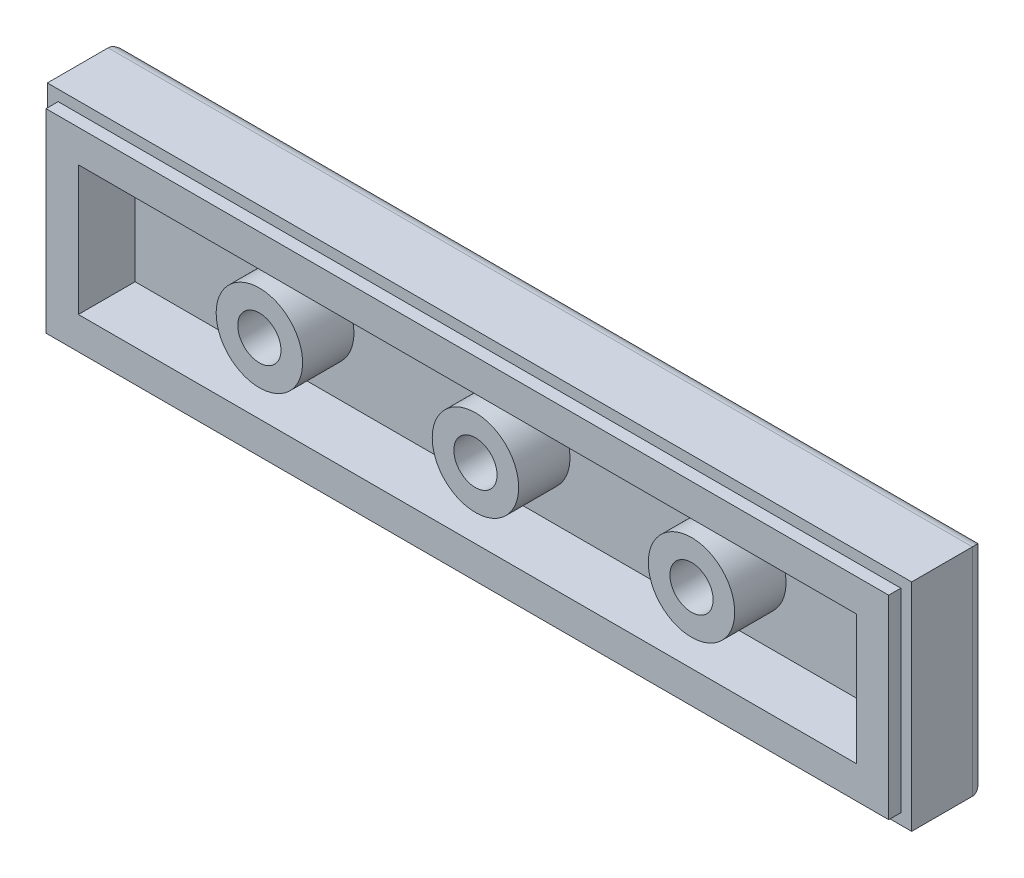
from build123d import *

# Parameters (mm, degrees)
SKIZZE1_W                       = 32
SKIZZE1_H                       = 8
LINEAR_AUSTRAGEN1_DEPTH         = 3.2
SKIZZE2_W                       = 28.8
SKIZZE2_H                       = 4.8
SCHNITT_LINEAR_AUSTRAGEN1_DEPTH = 2.1
SKIZZE3_R                       = 1.6
SKIZZE3_R_2                     = 0.8
LINEAR_AUSTRAGEN2_DEPTH         = 1.9
LINEARES_MUSTER2_COUNT          = 3
LINEARES_MUSTER2_PITCH          = 8
SKIZZE4_OUTSIDE_W               = 40.628
SKIZZE4_OUTSIDE_H               = 16.628
SKIZZE4_OUTSIDE_W_2             = 31.2
SKIZZE4_OUTSIDE_H_2             = 7.2
SCHNITT_LINEAR_AUSTRAGEN2_DEPTH = 0.45
VERRUNDUNG1_R                   = 0.5
LINEAR_AUSTRAGEN4_DEPTH         = 0.1


with BuildPart() as part:
    # Skizze1 → Linear austragen1 (new body)
    with BuildSketch(Plane.XY):
        with Locations((-16, -4)):
            Rectangle(SKIZZE1_W, SKIZZE1_H)
    extrude(amount=LINEAR_AUSTRAGEN1_DEPTH)

    # Skizze2 → Schnitt-Linear austragen1 (cut)
    with BuildSketch(Plane.XY.offset(3.2)):
        with Locations((-16, -4)):
            Rectangle(SKIZZE2_W, SKIZZE2_H)
    extrude(amount=-SCHNITT_LINEAR_AUSTRAGEN1_DEPTH, mode=Mode.SUBTRACT)

    # Skizze3 → Linear austragen2 (add)
    with BuildSketch(Plane.XY.offset(1.1)):
        with Locations(Location((-7.9, -4, 0), (0, 0, 180))):
            Circle(SKIZZE3_R)
        with Locations(Location((-7.9, -4, 0), (0, 0, 180))):
            Circle(SKIZZE3_R_2, mode=Mode.SUBTRACT)
    linear_austragen2 = extrude(amount=LINEAR_AUSTRAGEN2_DEPTH)

    # Lineares Muster2: Linear austragen2 ×3
    with Locations(*[(-i * LINEARES_MUSTER2_PITCH, 0, 0) for i in range(1, LINEARES_MUSTER2_COUNT)]):
        add(linear_austragen2)

    # Skizze4 outside → Schnitt-Linear austragen2 (cut)
    with BuildSketch(Plane.XY.offset(3.2)):
        with Locations((-16, -4)):
            Rectangle(SKIZZE4_OUTSIDE_W, SKIZZE4_OUTSIDE_H)
        with Locations((-16, -4)):
            Rectangle(SKIZZE4_OUTSIDE_W_2, SKIZZE4_OUTSIDE_H_2, mode=Mode.SUBTRACT)
    extrude(amount=-SCHNITT_LINEAR_AUSTRAGEN2_DEPTH, mode=Mode.SUBTRACT)

    # Verrundung1
    verrundung1_edges = [part.edges().sort_by_distance(p)[0] for p in [
        (-16, -8, 0),
        (-32, -4, 0),
        (-16, 0, 0),
        (0, -4, 0),
    ]]
    fillet(verrundung1_edges, radius=VERRUNDUNG1_R)

    # Skizze5 → Linear austragen4 (add)
    # profile 1 of 20: a face of its own
    with BuildSketch(Plane(origin=(0, 0, 0), x_dir=(-1, 0, 0), z_dir=(0, 0, -1))):
        with BuildLine():
            Line((2.254441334, -3.735848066), (2.231931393, -3.741944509))
            add(Edge.make_bspline(
                [(2.231931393, -3.741944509), (2.234772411, -3.741473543), (2.240432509, -3.740535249), (2.248858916, -3.744970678), (2.254325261, -3.754076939), (2.258950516, -3.766443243), (2.26193676, -3.782945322), (2.263573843, -3.803495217), (2.2647208, -3.828234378), (2.263831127, -3.846210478), (2.263351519, -3.855901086)],
                knots=[0, 0, 0, 0, 0.51779629, 1.031594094, 1.629263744, 2.429370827, 3.454555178, 4.694940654, 6.218299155, 8, 8, 8, 8], degree=3))
            add(Edge.make_bspline(
                [(2.263351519, -3.855901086), (2.262997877, -3.866695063), (2.262155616, -3.892402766), (2.259351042, -3.917974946), (2.257724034, -3.932810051)],
                knots=[0, 0, 0, 0, 0.839746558, 2, 2, 2, 2], degree=3))
            add(Edge.make_bspline(
                [(2.257724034, -3.932810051), (2.251930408, -3.943293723), (2.240837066, -3.963367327), (2.214174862, -3.985461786), (2.18222204, -3.999307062), (2.158766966, -4.000603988), (2.1465812, -4.001277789)],
                knots=[0, 0, 0, 0, 1.031466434, 1.974999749, 2.947938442, 4, 4, 4, 4], degree=3))
            add(Edge.make_bspline(
                [(2.1465812, -4.001277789), (2.136845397, -4.000779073), (2.118191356, -3.999823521), (2.093554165, -3.985988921), (2.072457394, -3.966231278), (2.064515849, -3.94808595), (2.060293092, -3.938437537)],
                knots=[0, 0, 0, 0, 1.011794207, 1.938622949, 2.903904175, 4, 4, 4, 4], degree=3))
            add(Edge.make_bspline(
                [(2.060293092, -3.938437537), (2.059262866, -3.932195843), (2.057005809, -3.91852131), (2.055469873, -3.895620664), (2.053901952, -3.868740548), (2.053788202, -3.849339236), (2.053727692, -3.83901863)],
                knots=[0, 0, 0, 0, 0.760652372, 1.666465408, 2.758666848, 4, 4, 4, 4], degree=3))
            Line((2.053727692, -3.83901863), (2.053727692, -3.761640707))
            add(Edge.make_bspline(
                [(2.053727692, -3.761640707), (2.056088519, -3.75185401), (2.06060173, -3.733144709), (2.077018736, -3.709743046), (2.099218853, -3.692230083), (2.117081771, -3.686381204), (2.126416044, -3.68332487)],
                knots=[0, 0, 0, 0, 1.058041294, 2.022665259, 2.966743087, 4, 4, 4, 4], degree=3))
            add(Edge.make_bspline(
                [(2.126416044, -3.68332487), (2.139462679, -3.683898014), (2.164557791, -3.685000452), (2.199780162, -3.694984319), (2.230679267, -3.711523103), (2.246516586, -3.72773559), (2.254441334, -3.735848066)],
                knots=[0, 0, 0, 0, 1.094303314, 2.104884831, 3.051713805, 4, 4, 4, 4], degree=3))
        make_face()
    # profile 2 of 20: a face of its own
    with BuildSketch(Plane(origin=(0, 0, 0), x_dir=(-1, 0, 0), z_dir=(0, 0, -1))):
        with BuildLine():
            Line((2.255379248, -4.435532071), (2.263820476, -4.468359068))
            Line((2.263820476, -4.468359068), (2.263820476, -5.823645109))
            add(Edge.make_bspline(
                [(2.263820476, -5.823645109), (2.259324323, -5.835818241), (2.250734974, -5.859073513), (2.224288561, -5.886701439), (2.187805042, -5.901798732), (2.160947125, -5.903432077), (2.1465812, -5.904305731)],
                knots=[0, 0, 0, 0, 1.002147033, 1.914478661, 2.884483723, 4, 4, 4, 4], degree=3))
            add(Edge.make_bspline(
                [(2.1465812, -5.904305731), (2.134381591, -5.903599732), (2.111782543, -5.902291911), (2.081434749, -5.887593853), (2.061291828, -5.861281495), (2.056351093, -5.84006764), (2.053727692, -5.828803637)],
                knots=[0, 0, 0, 0, 1.101266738, 2.040030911, 2.959307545, 4, 4, 4, 4], degree=3))
            Line((2.053727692, -5.828803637), (2.053727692, -4.443973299))
            add(Edge.make_bspline(
                [(2.053727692, -4.443973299), (2.058134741, -4.433308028), (2.066328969, -4.413477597), (2.086732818, -4.390443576), (2.111665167, -4.375678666), (2.130127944, -4.374321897), (2.139546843, -4.373629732)],
                knots=[0, 0, 0, 0, 1.157971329, 2.153069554, 3.057777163, 4, 4, 4, 4], degree=3))
            add(Edge.make_bspline(
                [(2.139546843, -4.373629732), (2.154355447, -4.374136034), (2.181276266, -4.375056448), (2.216898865, -4.386522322), (2.244117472, -4.406575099), (2.251636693, -4.425908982), (2.255379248, -4.435532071)],
                knots=[0, 0, 0, 0, 1.250424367, 2.273168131, 3.140500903, 4, 4, 4, 4], degree=3))
        make_face()
    # profile 3 of 20: a face of its own
    with BuildSketch(Plane(origin=(0, 0, 0), x_dir=(-1, 0, 0), z_dir=(0, 0, -1))):
        with BuildLine():
            add(Edge.make_bspline(
                [(3.407137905, -4.376443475), (3.431637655, -4.377614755), (3.480203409, -4.379936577), (3.55106591, -4.398649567), (3.618796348, -4.428542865), (3.681149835, -4.470296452), (3.737528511, -4.518169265), (3.785279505, -4.569830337), (3.823646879, -4.62418161), (3.840904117, -4.663430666), (3.849364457, -4.682672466)],
                knots=[0, 0, 0, 0, 1.033662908, 2.049025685, 3.074812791, 4.148044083, 5.20661057, 6.192694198, 7.113970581, 8, 8, 8, 8], degree=3))
            add(Edge.make_bspline(
                [(3.849364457, -4.682672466), (3.85724689, -4.70484999), (3.87330076, -4.750018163), (3.880746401, -4.797377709), (3.88453624, -4.82148377)],
                knots=[0, 0, 0, 0, 0.981997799, 2, 2, 2, 2], degree=3))
            Line((3.88453624, -4.82148377), (3.88453624, -5.82505198))
            add(Edge.make_bspline(
                [(3.88453624, -5.82505198), (3.883281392, -5.831408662), (3.88086963, -5.843625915), (3.872363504, -5.859774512), (3.861983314, -5.874008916), (3.848158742, -5.885179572), (3.831583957, -5.893884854), (3.81217173, -5.899751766), (3.789950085, -5.903514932), (3.774192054, -5.904032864), (3.765890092, -5.904305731)],
                knots=[0, 0, 0, 0, 0.983063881, 1.889403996, 2.757295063, 3.654811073, 4.572061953, 5.597579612, 6.734308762, 8, 8, 8, 8], degree=3))
            add(Edge.make_bspline(
                [(3.765890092, -5.904305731), (3.753968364, -5.903637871), (3.731684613, -5.902389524), (3.702211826, -5.886884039), (3.681759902, -5.860628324), (3.677000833, -5.839012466), (3.674443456, -5.827396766)],
                knots=[0, 0, 0, 0, 1.075037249, 2.009428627, 2.930327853, 4, 4, 4, 4], degree=3))
            Line((3.674443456, -5.827396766), (3.674443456, -4.813511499))
            add(Edge.make_bspline(
                [(3.674443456, -4.813511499), (3.672453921, -4.80061443), (3.668584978, -4.775534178), (3.65691469, -4.739803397), (3.641507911, -4.70675491), (3.621602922, -4.676430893), (3.597445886, -4.649141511), (3.569271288, -4.624404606), (3.537076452, -4.602301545), (3.513132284, -4.590615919), (3.500929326, -4.584660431)],
                knots=[0, 0, 0, 0, 1.038469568, 2.019457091, 2.983529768, 3.937163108, 4.89930216, 5.879023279, 6.9190608, 8, 8, 8, 8], degree=3))
            add(Edge.make_bspline(
                [(3.500929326, -4.584660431), (3.491810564, -4.579900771), (3.473874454, -4.57053878), (3.445235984, -4.560464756), (3.415648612, -4.554830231), (3.395593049, -4.554082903), (3.385565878, -4.553709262)],
                knots=[0, 0, 0, 0, 1.020962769, 2.008178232, 3.004149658, 4, 4, 4, 4], degree=3))
            Line((3.385565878, -4.553709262), (2.984138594, -4.553709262))
            Line((2.984138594, -4.553709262), (2.984138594, -5.824114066))
            add(Edge.make_bspline(
                [(2.984138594, -5.824114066), (2.97901635, -5.836357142), (2.969240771, -5.859722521), (2.941446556, -5.886002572), (2.905932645, -5.901955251), (2.879590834, -5.9034863), (2.865492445, -5.904305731)],
                knots=[0, 0, 0, 0, 1.025291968, 1.956725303, 2.9064199, 4, 4, 4, 4], degree=3))
            add(Edge.make_bspline(
                [(2.865492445, -5.904305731), (2.853563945, -5.903643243), (2.831267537, -5.902404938), (2.801991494, -5.886891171), (2.781338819, -5.86117551), (2.776594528, -5.839811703), (2.774045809, -5.82833468)],
                knots=[0, 0, 0, 0, 1.081721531, 2.021922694, 2.937341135, 4, 4, 4, 4], degree=3))
            Line((2.774045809, -5.82833468), (2.774045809, -4.443035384))
            add(Edge.make_bspline(
                [(2.774045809, -4.443035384), (2.778822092, -4.432545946), (2.787654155, -4.413149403), (2.808168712, -4.390251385), (2.833431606, -4.375686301), (2.852173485, -4.374324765), (2.861740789, -4.373629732)],
                knots=[0, 0, 0, 0, 1.152945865, 2.131969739, 3.046412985, 4, 4, 4, 4], degree=3))
            Line((2.861740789, -4.373629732), (3.407137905, -4.376443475))
        make_face()
    # profile 4 of 20: a face of its own
    with BuildSketch(Plane(origin=(0, 0, 0), x_dir=(-1, 0, 0), z_dir=(0, 0, -1))):
        with BuildLine():
            add(Edge.make_bspline(
                [(5.274525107, -3.736317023), (5.278744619, -3.74362686), (5.286574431, -3.757191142), (5.287956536, -3.772754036), (5.28859382, -3.779930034)],
                knots=[0, 0, 0, 0, 1.077806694, 2, 2, 2, 2], degree=3))
            add(Edge.make_bspline(
                [(5.28859382, -3.779930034), (5.28836707, -3.784514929), (5.28788449, -3.794272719), (5.281798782, -3.808876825), (5.274260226, -3.825039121), (5.26646845, -3.835090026), (5.262332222, -3.840425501)],
                knots=[0, 0, 0, 0, 0.815099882, 1.734733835, 2.797494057, 4, 4, 4, 4], degree=3))
            add(Edge.make_bspline(
                [(5.262332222, -3.840425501), (5.255865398, -3.846273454), (5.241830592, -3.858965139), (5.212603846, -3.87117444), (5.176289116, -3.879181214), (5.149365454, -3.88141901), (5.134775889, -3.882631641)],
                knots=[0, 0, 0, 0, 0.757064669, 1.643040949, 2.722796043, 4, 4, 4, 4], degree=3))
            add(Edge.make_bspline(
                [(5.134775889, -3.882631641), (5.128353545, -3.882992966), (5.116716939, -3.883647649), (5.101200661, -3.88596004), (5.089344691, -3.888776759), (5.083308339, -3.892072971), (5.080845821, -3.893417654)],
                knots=[0, 0, 0, 0, 1.389585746, 2.517781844, 3.395331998, 4, 4, 4, 4], degree=3))
            add(Edge.make_bspline(
                [(5.080845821, -3.893417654), (5.066874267, -3.898755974), (5.038846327, -3.909465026), (5.000377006, -3.93380464), (4.963899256, -3.96239955), (4.930866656, -3.996422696), (4.902422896, -4.03477845), (4.878916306, -4.076293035), (4.862506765, -4.12124582), (4.856138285, -4.15249635), (4.852932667, -4.168226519)],
                knots=[0, 0, 0, 0, 0.956596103, 1.919000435, 2.903377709, 3.9238173, 4.947940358, 5.957248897, 6.971767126, 8, 8, 8, 8], degree=3))
            add(Edge.make_bspline(
                [(4.852932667, -4.168226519), (4.850466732, -4.184769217), (4.845458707, -4.218365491), (4.84388393, -4.252297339), (4.843084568, -4.269521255)],
                knots=[0, 0, 0, 0, 0.984793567, 2, 2, 2, 2], degree=3))
            add(Edge.make_bspline(
                [(4.843084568, -4.269521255), (4.844564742, -4.277169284), (4.847875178, -4.294274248), (4.845394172, -4.311553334), (4.844022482, -4.321106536)],
                knots=[0, 0, 0, 0, 0.894246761, 2, 2, 2, 2], degree=3))
            add(Edge.make_bspline(
                [(4.844022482, -4.321106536), (4.844427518, -4.32923335), (4.845112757, -4.342982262), (4.845004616, -4.356746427), (4.844960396, -4.362374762)],
                knots=[0, 0, 0, 0, 1.182175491, 2, 2, 2, 2], degree=3))
            Line((4.844960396, -4.362374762), (4.844960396, -4.373629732))
            Line((4.844960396, -4.373629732), (5.180264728, -4.37409869))
            add(Edge.make_bspline(
                [(5.180264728, -4.37409869), (5.194531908, -4.376539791), (5.220356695, -4.38095839), (5.253539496, -4.396461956), (5.277409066, -4.419469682), (5.282383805, -4.439321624), (5.284842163, -4.449131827)],
                knots=[0, 0, 0, 0, 1.247910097, 2.25882149, 3.139564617, 4, 4, 4, 4], degree=3))
            add(Edge.make_bspline(
                [(5.284842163, -4.449131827), (5.284175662, -4.458486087), (5.282868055, -4.476838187), (5.270568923, -4.502552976), (5.250514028, -4.524664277), (5.233110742, -4.535674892), (5.223877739, -4.541516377)],
                knots=[0, 0, 0, 0, 0.960066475, 1.883552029, 2.877156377, 4, 4, 4, 4], degree=3))
            Line((5.223877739, -4.541516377), (5.202305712, -4.553709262))
            Line((5.202305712, -4.553709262), (4.844960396, -4.553709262))
            Line((4.844960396, -4.553709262), (4.844491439, -5.798321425))
            add(Edge.make_bspline(
                [(4.844491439, -5.798321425), (4.842317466, -5.806633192), (4.837836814, -5.823764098), (4.817344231, -5.844533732), (4.789833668, -5.862484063), (4.767217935, -5.870133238), (4.754920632, -5.874292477)],
                knots=[0, 0, 0, 0, 0.821168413, 1.692463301, 2.745277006, 4, 4, 4, 4], degree=3))
            add(Edge.make_bspline(
                [(4.754920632, -5.874292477), (4.742512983, -5.873977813), (4.719612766, -5.873397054), (4.688706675, -5.865979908), (4.663345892, -5.85399944), (4.652036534, -5.841107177), (4.64659154, -5.83490008)],
                knots=[0, 0, 0, 0, 1.242766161, 2.293715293, 3.17849361, 4, 4, 4, 4], degree=3))
            Line((4.64659154, -5.83490008), (4.634867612, -5.806293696))
            Line((4.634867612, -5.806293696), (4.634867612, -4.553709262))
            Line((4.634867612, -4.553709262), (4.473546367, -4.553709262))
            add(Edge.make_bspline(
                [(4.473546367, -4.553709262), (4.463812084, -4.551089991), (4.445203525, -4.546082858), (4.421247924, -4.530675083), (4.403686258, -4.508692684), (4.397823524, -4.491130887), (4.394761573, -4.481958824)],
                knots=[0, 0, 0, 0, 1.068106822, 2.0418483, 2.977309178, 4, 4, 4, 4], degree=3))
            add(Edge.make_bspline(
                [(4.394761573, -4.481958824), (4.395329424, -4.470934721), (4.396392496, -4.450296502), (4.405785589, -4.422137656), (4.421974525, -4.399255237), (4.437186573, -4.389736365), (4.444939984, -4.384884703)],
                knots=[0, 0, 0, 0, 1.146160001, 2.145725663, 3.054897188, 4, 4, 4, 4], degree=3))
            Line((4.444939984, -4.384884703), (4.475422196, -4.373629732))
            Line((4.475422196, -4.373629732), (4.634867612, -4.373629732))
            Line((4.634867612, -4.373629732), (4.634867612, -4.321106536))
            add(Edge.make_bspline(
                [(4.634867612, -4.321106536), (4.635296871, -4.299371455), (4.636131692, -4.257101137), (4.640596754, -4.195512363), (4.648980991, -4.137846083), (4.660852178, -4.084175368), (4.675050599, -4.034086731), (4.693430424, -3.988146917), (4.714859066, -3.945866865), (4.732287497, -3.920446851), (4.740851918, -3.907955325)],
                knots=[0, 0, 0, 0, 1.203497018, 2.340557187, 3.41641994, 4.426498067, 5.382319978, 6.295172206, 7.162238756, 8, 8, 8, 8], degree=3))
            add(Edge.make_bspline(
                [(4.740851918, -3.907955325), (4.755011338, -3.890116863), (4.782858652, -3.85503398), (4.830452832, -3.808903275), (4.882070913, -3.769879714), (4.938013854, -3.738381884), (4.997704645, -3.713173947), (5.061670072, -3.696243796), (5.129205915, -3.684796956), (5.175681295, -3.683823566), (5.19949197, -3.68332487)],
                knots=[0, 0, 0, 0, 1.027916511, 2.021602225, 2.984713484, 3.942842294, 4.91453441, 5.902912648, 6.925601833, 8, 8, 8, 8], degree=3))
            add(Edge.make_bspline(
                [(5.19949197, -3.68332487), (5.208823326, -3.687826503), (5.225820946, -3.696026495), (5.247553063, -3.709776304), (5.264148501, -3.722342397), (5.271397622, -3.732105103), (5.274525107, -3.736317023)],
                knots=[0, 0, 0, 0, 1.336921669, 2.435282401, 3.324934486, 4, 4, 4, 4], degree=3))
        make_face()
    # profile 5 of 20: a face of its own
    with BuildSketch(Plane(origin=(0, 0, 0), x_dir=(-1, 0, 0), z_dir=(0, 0, -1))):
        with BuildLine():
            add(Edge.make_bspline(
                [(6.842717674, -4.71127885), (6.849206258, -4.730433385), (6.861498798, -4.766721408), (6.875407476, -4.819585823), (6.883851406, -4.867951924), (6.885217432, -4.898833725), (6.885861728, -4.913399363)],
                knots=[0, 0, 0, 0, 1.168861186, 2.214392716, 3.157804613, 4, 4, 4, 4], degree=3))
            Line((6.885861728, -4.913399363), (6.885861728, -5.407680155))
            add(Edge.make_bspline(
                [(6.885861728, -5.407680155), (6.884733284, -5.430638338), (6.882461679, -5.476854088), (6.862167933, -5.545072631), (6.831017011, -5.612147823), (6.787726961, -5.676549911), (6.735590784, -5.736926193), (6.673634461, -5.78848075), (6.605310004, -5.833171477), (6.554996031, -5.854847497), (6.529454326, -5.865851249)],
                knots=[0, 0, 0, 0, 0.895127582, 1.801927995, 2.758191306, 3.776131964, 4.823416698, 5.863375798, 6.915350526, 8, 8, 8, 8], degree=3))
            add(Edge.make_bspline(
                [(6.529454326, -5.865851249), (6.512998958, -5.871868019), (6.480105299, -5.883895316), (6.428667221, -5.894944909), (6.376369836, -5.903178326), (6.340967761, -5.903927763), (6.323113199, -5.904305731)],
                knots=[0, 0, 0, 0, 0.995005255, 1.988977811, 2.985767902, 4, 4, 4, 4], degree=3))
            add(Edge.make_bspline(
                [(6.323113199, -5.904305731), (6.304804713, -5.903851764), (6.268674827, -5.902955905), (6.215509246, -5.895961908), (6.164766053, -5.883494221), (6.115866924, -5.867251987), (6.069576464, -5.845394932), (6.025023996, -5.819614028), (5.983084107, -5.788533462), (5.957565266, -5.764508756), (5.944664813, -5.752363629)],
                knots=[0, 0, 0, 0, 1.048966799, 2.070026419, 3.065058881, 4.039477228, 5.017306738, 5.992836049, 6.985325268, 8, 8, 8, 8], degree=3))
            add(Edge.make_bspline(
                [(5.944664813, -5.752363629), (5.93108331, -5.738241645), (5.904424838, -5.71052229), (5.869878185, -5.664891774), (5.840749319, -5.616922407), (5.816684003, -5.56670622), (5.798316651, -5.514139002), (5.785164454, -5.45931916), (5.777053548, -5.402137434), (5.775936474, -5.363155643), (5.775371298, -5.343433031)],
                knots=[0, 0, 0, 0, 1.032971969, 2.027570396, 3.011961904, 3.989489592, 4.959754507, 5.943869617, 6.959712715, 8, 8, 8, 8], degree=3))
            add(Edge.make_bspline(
                [(5.775371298, -5.343433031), (5.775371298, -5.33546076), (5.775371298, -5.322173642), (5.775371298, -5.308886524), (5.775371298, -5.303571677)],
                knots=[0, 0, 0, 0, 1.2, 2, 2, 2, 2], degree=3))
            Line((5.775371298, -5.303571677), (5.775371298, -4.874006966))
            add(Edge.make_bspline(
                [(5.775371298, -4.874006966), (5.778256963, -4.849528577), (5.783883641, -4.801798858), (5.801422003, -4.733231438), (5.826315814, -4.669807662), (5.858893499, -4.611506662), (5.899345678, -4.558673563), (5.946405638, -4.510384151), (6.001518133, -4.467747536), (6.042372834, -4.444277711), (6.063310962, -4.432249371)],
                knots=[0, 0, 0, 0, 1.070872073, 2.088063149, 3.067559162, 4.02619596, 4.981912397, 5.952856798, 6.950834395, 8, 8, 8, 8], degree=3))
            add(Edge.make_bspline(
                [(6.063310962, -4.432249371), (6.082162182, -4.423102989), (6.120132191, -4.404680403), (6.181722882, -4.386885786), (6.246730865, -4.375720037), (6.291331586, -4.374338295), (6.314203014, -4.373629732)],
                knots=[0, 0, 0, 0, 0.965049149, 1.943795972, 2.945570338, 4, 4, 4, 4], degree=3))
            add(Edge.make_bspline(
                [(6.314203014, -4.373629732), (6.343531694, -4.374770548), (6.401523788, -4.3770263), (6.486295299, -4.395978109), (6.567120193, -4.426892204), (6.642540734, -4.469247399), (6.710266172, -4.520027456), (6.767831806, -4.577289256), (6.813012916, -4.641062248), (6.832886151, -4.688038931), (6.842717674, -4.71127885)],
                knots=[0, 0, 0, 0, 1.057470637, 2.090954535, 3.117688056, 4.170816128, 5.202049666, 6.163408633, 7.09141663, 8, 8, 8, 8], degree=3))
        make_face()
        with BuildLine():
            add(Edge.make_bspline(
                [(6.568377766, -4.655003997), (6.559310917, -4.646841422), (6.54140519, -4.630721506), (6.512092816, -4.610081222), (6.481606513, -4.592680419), (6.449825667, -4.578548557), (6.416936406, -4.567124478), (6.38265806, -4.559278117), (6.347173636, -4.554372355), (6.32312957, -4.553932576), (6.310920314, -4.553709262)],
                knots=[0, 0, 0, 0, 1.031421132, 2.036908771, 3.026085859, 3.996968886, 4.975657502, 5.966954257, 6.967646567, 8, 8, 8, 8], degree=3))
            add(Edge.make_bspline(
                [(6.310920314, -4.553709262), (6.289566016, -4.554939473), (6.245590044, -4.55747291), (6.204810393, -4.574186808), (6.183832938, -4.582784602)],
                knots=[0, 0, 0, 0, 0.971180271, 2, 2, 2, 2], degree=3))
            add(Edge.make_bspline(
                [(6.183832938, -4.582784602), (6.169523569, -4.589717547), (6.141566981, -4.603262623), (6.104496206, -4.630162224), (6.071623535, -4.659651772), (6.043950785, -4.693408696), (6.02205063, -4.73129901), (6.004466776, -4.772677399), (5.991663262, -4.817737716), (5.987560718, -4.84938973), (5.985464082, -4.865565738)],
                knots=[0, 0, 0, 0, 1.048400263, 2.048287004, 3.013061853, 3.959708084, 4.917773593, 5.893974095, 6.923699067, 8, 8, 8, 8], degree=3))
            Line((5.985464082, -4.865565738), (5.985464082, -5.391735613))
            add(Edge.make_bspline(
                [(5.985464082, -5.391735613), (5.9858853, -5.405368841), (5.986709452, -5.432043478), (5.994084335, -5.471110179), (6.005765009, -5.508323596), (6.022226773, -5.543708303), (6.043794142, -5.577055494), (6.070060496, -5.608258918), (6.100963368, -5.637742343), (6.12408775, -5.65520469), (6.135999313, -5.664199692)],
                knots=[0, 0, 0, 0, 1.007554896, 1.971371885, 2.929415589, 3.886342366, 4.848493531, 5.858102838, 6.896690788, 8, 8, 8, 8], degree=3))
            add(Edge.make_bspline(
                [(6.135999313, -5.664199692), (6.150286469, -5.673419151), (6.178139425, -5.69139258), (6.223066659, -5.70992108), (6.268383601, -5.722095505), (6.29896408, -5.72351756), (6.314203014, -5.724226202)],
                knots=[0, 0, 0, 0, 1.067046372, 2.080217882, 3.04332975, 4, 4, 4, 4], degree=3))
            add(Edge.make_bspline(
                [(6.314203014, -5.724226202), (6.336055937, -5.723219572), (6.37938125, -5.721223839), (6.441946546, -5.702920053), (6.500950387, -5.674303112), (6.55453683, -5.634628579), (6.601052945, -5.586969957), (6.638042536, -5.53304531), (6.664259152, -5.473698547), (6.671912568, -5.431358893), (6.675768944, -5.41002494)],
                knots=[0, 0, 0, 0, 1.00369711, 1.989916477, 2.974455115, 4.009028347, 5.041799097, 6.0255226, 7.00510742, 8, 8, 8, 8], degree=3))
            Line((6.675768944, -5.41002494), (6.675768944, -4.872131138))
            add(Edge.make_bspline(
                [(6.675768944, -4.872131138), (6.671859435, -4.850339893), (6.664284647, -4.808118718), (6.640306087, -4.749854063), (6.609930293, -4.697337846), (6.582151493, -4.669036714), (6.568377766, -4.655003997)],
                knots=[0, 0, 0, 0, 1.073189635, 2.079336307, 3.047665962, 4, 4, 4, 4], degree=3))
        make_face(mode=Mode.SUBTRACT)
    # profile 6 of 20: a face of its own
    with BuildSketch(Plane(origin=(0, 0, 0), x_dir=(-1, 0, 0), z_dir=(0, 0, -1))):
        with BuildLine():
            add(Edge.make_bspline(
                [(9.290204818, -4.274210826), (9.303503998, -4.307912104), (9.32936752, -4.373452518), (9.356635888, -4.47302366), (9.373268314, -4.569874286), (9.375749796, -4.633684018), (9.376961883, -4.664852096)],
                knots=[0, 0, 0, 0, 1.079081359, 2.098538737, 3.07122487, 4, 4, 4, 4], degree=3))
            Line((9.376961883, -4.664852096), (9.376961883, -5.545553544))
            add(Edge.make_bspline(
                [(9.376961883, -5.545553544), (9.37468066, -5.56270518), (9.370100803, -5.597139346), (9.353415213, -5.647215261), (9.330215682, -5.695848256), (9.300617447, -5.742388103), (9.264304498, -5.784867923), (9.220860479, -5.820167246), (9.172218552, -5.849543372), (9.136341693, -5.862529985), (9.11809756, -5.869133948)],
                knots=[0, 0, 0, 0, 0.945078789, 1.897370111, 2.873118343, 3.888775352, 4.907597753, 5.916386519, 6.940439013, 8, 8, 8, 8], degree=3))
            add(Edge.make_bspline(
                [(9.11809756, -5.869133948), (9.096372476, -5.875698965), (9.05352965, -5.888645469), (9.008825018, -5.890653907), (8.98678957, -5.89164389)],
                knots=[0, 0, 0, 0, 1.014176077, 2, 2, 2, 2], degree=3))
            add(Edge.make_bspline(
                [(8.98678957, -5.89164389), (8.970643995, -5.891330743), (8.939388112, -5.89072453), (8.894794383, -5.882208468), (8.853505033, -5.870388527), (8.816445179, -5.852374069), (8.782739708, -5.829490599), (8.753470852, -5.801198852), (8.727260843, -5.768298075), (8.714082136, -5.743236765), (8.707291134, -5.730322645)],
                knots=[0, 0, 0, 0, 1.130430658, 2.188377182, 3.173263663, 4.134250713, 5.064678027, 6.018384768, 6.978871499, 8, 8, 8, 8], degree=3))
            add(Edge.make_bspline(
                [(8.707291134, -5.730322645), (8.699266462, -5.743296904), (8.683539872, -5.768723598), (8.652930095, -5.801273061), (8.619316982, -5.830084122), (8.580068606, -5.852333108), (8.537238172, -5.870607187), (8.489529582, -5.882185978), (8.4379476, -5.890737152), (8.401883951, -5.891334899), (8.383241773, -5.89164389)],
                knots=[0, 0, 0, 0, 0.959260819, 1.879940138, 2.803462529, 3.739723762, 4.711454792, 5.729590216, 6.826369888, 8, 8, 8, 8], degree=3))
            add(Edge.make_bspline(
                [(8.383241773, -5.89164389), (8.359846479, -5.890414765), (8.313346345, -5.887971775), (8.244974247, -5.869908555), (8.17965368, -5.839651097), (8.128338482, -5.805846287), (8.090549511, -5.773609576), (8.064694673, -5.747727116), (8.041482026, -5.720752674), (8.02226303, -5.691708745), (8.00559789, -5.661508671), (7.992153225, -5.6297625), (7.981439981, -5.596528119), (7.977332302, -5.57359672), (7.975249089, -5.561967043)],
                knots=[0, 0, 0, 0, 1.481379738, 2.944368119, 4.446887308, 6.026433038, 6.820340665, 7.590731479, 8.34275784, 9.070723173, 9.793210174, 10.525408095, 11.25215959, 12, 12, 12, 12], degree=3))
            Line((7.975249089, -5.561967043), (7.966338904, -5.50569219))
            Line((7.966338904, -5.50569219), (7.966338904, -4.756767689))
            add(Edge.make_bspline(
                [(7.966338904, -4.756767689), (7.967489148, -4.737433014), (7.969791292, -4.698735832), (7.986592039, -4.641716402), (8.014305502, -4.586805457), (8.0523255, -4.535325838), (8.09637627, -4.488134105), (8.14544046, -4.448252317), (8.198426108, -4.417022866), (8.236362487, -4.40338601), (8.255216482, -4.396608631)],
                knots=[0, 0, 0, 0, 0.944780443, 1.890920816, 2.882395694, 3.939072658, 5.009896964, 6.03190732, 7.02187793, 8, 8, 8, 8], degree=3))
            add(Edge.make_bspline(
                [(8.255216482, -4.396608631), (8.266411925, -4.393099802), (8.290958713, -4.385406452), (8.332478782, -4.378163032), (8.381624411, -4.374966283), (8.416846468, -4.374401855), (8.435764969, -4.37409869)],
                knots=[0, 0, 0, 0, 0.769650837, 1.687513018, 2.757915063, 4, 4, 4, 4], degree=3))
            Line((8.435764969, -4.37409869), (8.736835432, -4.377381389))
            add(Edge.make_bspline(
                [(8.736835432, -4.377381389), (8.749230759, -4.380226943), (8.772515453, -4.385572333), (8.802895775, -4.402281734), (8.825572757, -4.426235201), (8.832978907, -4.446115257), (8.836723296, -4.456166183)],
                knots=[0, 0, 0, 0, 1.130318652, 2.123310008, 3.05118619, 4, 4, 4, 4], degree=3))
            Line((8.836723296, -4.456166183), (8.836723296, -5.551649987))
            add(Edge.make_bspline(
                [(8.836723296, -5.551649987), (8.839382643, -5.568199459), (8.844353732, -5.599135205), (8.865699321, -5.63938047), (8.895517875, -5.67126179), (8.921815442, -5.68211955), (8.935204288, -5.687647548)],
                knots=[0, 0, 0, 0, 1.123632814, 2.100394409, 3.032856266, 4, 4, 4, 4], degree=3))
            add(Edge.make_bspline(
                [(8.935204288, -5.687647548), (8.942666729, -5.689640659), (8.958636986, -5.693906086), (8.975168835, -5.694412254), (8.983975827, -5.694681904)],
                knots=[0, 0, 0, 0, 0.934542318, 2, 2, 2, 2], degree=3))
            add(Edge.make_bspline(
                [(8.983975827, -5.694681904), (8.99526912, -5.694244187), (9.016813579, -5.693409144), (9.047429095, -5.686758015), (9.074923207, -5.675681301), (9.090320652, -5.664232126), (9.097932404, -5.658572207)],
                knots=[0, 0, 0, 0, 1.11036768, 2.118272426, 3.06976489, 4, 4, 4, 4], degree=3))
            add(Edge.make_bspline(
                [(9.097932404, -5.658572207), (9.10743164, -5.649887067), (9.126310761, -5.632625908), (9.146923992, -5.599977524), (9.160966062, -5.563401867), (9.164861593, -5.537387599), (9.166869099, -5.523981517)],
                knots=[0, 0, 0, 0, 0.991662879, 1.970866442, 2.954314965, 4, 4, 4, 4], degree=3))
            Line((9.166869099, -5.523981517), (9.166869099, -4.604825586))
            add(Edge.make_bspline(
                [(9.166869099, -4.604825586), (9.166412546, -4.587295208), (9.165495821, -4.552095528), (9.158197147, -4.499516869), (9.1463938, -4.447135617), (9.12993749, -4.395049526), (9.108739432, -4.343298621), (9.08263618, -4.292015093), (9.052322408, -4.240762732), (9.028781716, -4.207918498), (9.016802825, -4.191205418)],
                knots=[0, 0, 0, 0, 0.939532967, 1.886511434, 2.840030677, 3.815395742, 4.81138783, 5.834544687, 6.898088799, 8, 8, 8, 8], degree=3))
            add(Edge.make_bspline(
                [(9.016802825, -4.191205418), (9.004322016, -4.175424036), (8.979759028, -4.144365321), (8.940207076, -4.100875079), (8.898270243, -4.061494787), (8.85457108, -4.025320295), (8.809264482, -3.992271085), (8.761383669, -3.963623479), (8.711853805, -3.938250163), (8.67753566, -3.923988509), (8.660395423, -3.91686551)],
                knots=[0, 0, 0, 0, 1.059539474, 2.085237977, 3.092833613, 4.086917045, 5.071786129, 6.04324558, 7.022696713, 8, 8, 8, 8], degree=3))
            add(Edge.make_bspline(
                [(8.660395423, -3.91686551), (8.636763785, -3.90862269), (8.590062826, -3.89233319), (8.518458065, -3.875567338), (8.44669618, -3.865309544), (8.398750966, -3.864039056), (8.374800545, -3.863404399)],
                knots=[0, 0, 0, 0, 1.027662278, 2.030871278, 3.016346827, 4, 4, 4, 4], degree=3))
            add(Edge.make_bspline(
                [(8.374800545, -3.863404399), (8.350066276, -3.863987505), (8.301157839, -3.865140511), (8.229016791, -3.875776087), (8.159338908, -3.893239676), (8.091827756, -3.917150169), (8.026912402, -3.948390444), (7.964171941, -3.986275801), (7.903336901, -4.030599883), (7.866111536, -4.065280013), (7.847223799, -4.082876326)],
                knots=[0, 0, 0, 0, 1.011786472, 2.000661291, 2.976621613, 3.947894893, 4.926514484, 5.919437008, 6.944345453, 8, 8, 8, 8], degree=3))
            add(Edge.make_bspline(
                [(7.847223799, -4.082876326), (7.828098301, -4.102395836), (7.790424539, -4.140845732), (7.741060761, -4.203403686), (7.699441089, -4.26896412), (7.665734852, -4.337325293), (7.638447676, -4.407954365), (7.619927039, -4.48166411), (7.608246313, -4.55802377), (7.606874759, -4.60994119), (7.606179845, -4.636245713)],
                knots=[0, 0, 0, 0, 1.055700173, 2.079537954, 3.073542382, 4.051701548, 5.02123877, 5.994290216, 6.983785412, 8, 8, 8, 8], degree=3))
            Line((7.606179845, -4.636245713), (7.606179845, -5.725633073))
            add(Edge.make_bspline(
                [(7.606179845, -5.725633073), (7.606698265, -5.742376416), (7.607723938, -5.775502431), (7.613889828, -5.824822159), (7.624525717, -5.873097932), (7.640498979, -5.920240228), (7.659589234, -5.966777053), (7.682986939, -6.012463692), (7.711622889, -6.056650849), (7.743551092, -6.099752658), (7.778375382, -6.140613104), (7.814960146, -6.178127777), (7.852687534, -6.212156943), (7.89150793, -6.242612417), (7.931534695, -6.269597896), (7.972947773, -6.292655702), (8.01568711, -6.31195576), (8.045042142, -6.322202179), (8.059661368, -6.327305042)],
                knots=[0, 0, 0, 0, 1.003041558, 1.984476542, 2.972722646, 3.958792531, 4.962183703, 5.984061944, 7.028305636, 8.112671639, 9.195378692, 10.24163571, 11.249473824, 12.236654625, 13.194990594, 14.138155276, 15.072774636, 16, 16, 16, 16], degree=3))
            add(Edge.make_bspline(
                [(8.059661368, -6.327305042), (8.081155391, -6.333694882), (8.122874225, -6.346097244), (8.184913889, -6.35932995), (8.244235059, -6.367056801), (8.282864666, -6.36839278), (8.301643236, -6.369042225)],
                knots=[0, 0, 0, 0, 1.091562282, 2.118668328, 3.085449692, 4, 4, 4, 4], degree=3))
            add(Edge.make_bspline(
                [(8.301643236, -6.369042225), (8.314997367, -6.3728249), (8.339318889, -6.379714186), (8.370385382, -6.397712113), (8.391389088, -6.422781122), (8.396290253, -6.442668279), (8.398717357, -6.45251659)],
                knots=[0, 0, 0, 0, 1.217538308, 2.217469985, 3.117274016, 4, 4, 4, 4], degree=3))
            add(Edge.make_bspline(
                [(8.398717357, -6.45251659), (8.397883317, -6.463826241), (8.396143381, -6.487419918), (8.384883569, -6.50825877), (8.379021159, -6.519108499)],
                knots=[0, 0, 0, 0, 0.95870177, 2, 2, 2, 2], degree=3))
            add(Edge.make_bspline(
                [(8.379021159, -6.519108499), (8.371148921, -6.526030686), (8.355322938, -6.539946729), (8.326613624, -6.554488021), (8.294333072, -6.563169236), (8.271687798, -6.564108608), (8.259906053, -6.564597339)],
                knots=[0, 0, 0, 0, 0.958345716, 1.926613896, 2.92127138, 4, 4, 4, 4], degree=3))
            add(Edge.make_bspline(
                [(8.259906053, -6.564597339), (8.252553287, -6.564199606), (8.23607961, -6.563308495), (8.211368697, -6.560347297), (8.188593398, -6.555891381), (8.174568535, -6.555411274), (8.168928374, -6.555218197)],
                knots=[0, 0, 0, 0, 0.965211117, 2.162529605, 3.261053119, 4, 4, 4, 4], degree=3))
            add(Edge.make_bspline(
                [(8.168928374, -6.555218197), (8.149191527, -6.552840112), (8.109786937, -6.548092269), (8.051322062, -6.535941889), (7.994136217, -6.518208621), (7.937438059, -6.496892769), (7.882167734, -6.469612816), (7.827171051, -6.439000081), (7.77353158, -6.402854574), (7.721153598, -6.363031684), (7.671153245, -6.319966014), (7.625900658, -6.273585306), (7.583621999, -6.226458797), (7.546755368, -6.176660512), (7.514082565, -6.125043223), (7.485543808, -6.07183727), (7.461190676, -6.016530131), (7.44876195, -5.978361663), (7.442513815, -5.959173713)],
                knots=[0, 0, 0, 0, 0.961526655, 1.919686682, 2.883826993, 3.85573668, 4.846788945, 5.862691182, 6.898855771, 7.972777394, 9.044913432, 10.08770809, 11.105775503, 12.105561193, 13.081171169, 14.058977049, 15.02421417, 16, 16, 16, 16], degree=3))
            add(Edge.make_bspline(
                [(7.442513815, -5.959173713), (7.435410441, -5.933784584), (7.421356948, -5.883554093), (7.407132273, -5.807321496), (7.397599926, -5.731659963), (7.396589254, -5.681267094), (7.396087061, -5.656227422)],
                knots=[0, 0, 0, 0, 1.028303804, 2.034422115, 3.023325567, 4, 4, 4, 4], degree=3))
            Line((7.396087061, -5.656227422), (7.396087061, -4.622176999))
            add(Edge.make_bspline(
                [(7.396087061, -4.622176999), (7.396619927, -4.599327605), (7.397682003, -4.553785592), (7.406525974, -4.4858757), (7.420428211, -4.418864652), (7.440404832, -4.35272768), (7.465743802, -4.287710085), (7.496421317, -4.223325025), (7.53316835, -4.160124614), (7.575020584, -4.098236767), (7.621266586, -4.039319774), (7.669701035, -3.983616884), (7.721764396, -3.933507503), (7.775607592, -3.887149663), (7.832718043, -3.845881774), (7.892074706, -3.808710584), (7.954319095, -3.776662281), (7.997315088, -3.758845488), (8.0188621, -3.749916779)],
                knots=[0, 0, 0, 0, 0.966272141, 1.925914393, 2.89211865, 3.85866228, 4.844756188, 5.841523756, 6.872535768, 7.934469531, 8.999302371, 10.039414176, 11.054181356, 12.05331509, 13.042685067, 14.031723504, 15.013617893, 16, 16, 16, 16], degree=3))
            add(Edge.make_bspline(
                [(8.0188621, -3.749916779), (8.047464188, -3.739709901), (8.104112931, -3.719494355), (8.191240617, -3.69842819), (8.278921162, -3.685908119), (8.337556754, -3.684185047), (8.366828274, -3.68332487)],
                knots=[0, 0, 0, 0, 1.02247999, 2.025104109, 3.014110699, 4, 4, 4, 4], degree=3))
            add(Edge.make_bspline(
                [(8.366828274, -3.68332487), (8.392012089, -3.683937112), (8.441864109, -3.685149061), (8.516047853, -3.692678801), (8.588601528, -3.705845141), (8.659604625, -3.72417701), (8.728995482, -3.747620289), (8.796438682, -3.777058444), (8.862986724, -3.810697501), (8.927006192, -3.849965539), (8.988188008, -3.892949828), (9.045548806, -3.938639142), (9.097774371, -3.987846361), (9.145809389, -4.039351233), (9.188965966, -4.093858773), (9.227667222, -4.151062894), (9.262285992, -4.210849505), (9.280892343, -4.253076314), (9.290204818, -4.274210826)],
                knots=[0, 0, 0, 0, 1.042700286, 2.064052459, 3.083434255, 4.092761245, 5.097658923, 6.112325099, 7.136952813, 8.182521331, 9.218531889, 10.231297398, 11.2157295, 12.186601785, 13.144793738, 14.090777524, 15.044434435, 16, 16, 16, 16], degree=3))
        make_face()
        with BuildLine():
            Line((8.626630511, -5.490216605), (8.626630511, -4.558398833))
            Line((8.626630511, -4.558398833), (8.603651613, -4.558398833))
            add(Edge.make_bspline(
                [(8.603651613, -4.558398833), (8.593178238, -4.558398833), (8.567698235, -4.558398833), (8.542218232, -4.558398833), (8.527211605, -4.558398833)],
                knots=[0, 0, 0, 0, 0.82208589, 2, 2, 2, 2], degree=3))
            add(Edge.make_bspline(
                [(8.527211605, -4.558398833), (8.51955441, -4.557880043), (8.50533875, -4.556916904), (8.485932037, -4.556306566), (8.470171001, -4.554914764), (8.460934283, -4.555054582), (8.456868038, -4.555116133)],
                knots=[0, 0, 0, 0, 1.307371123, 2.427148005, 3.307589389, 4, 4, 4, 4], degree=3))
            add(Edge.make_bspline(
                [(8.456868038, -4.555116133), (8.442320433, -4.555374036), (8.414253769, -4.555871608), (8.37359321, -4.560023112), (8.336099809, -4.567428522), (8.312535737, -4.57462516), (8.301174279, -4.578095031)],
                knots=[0, 0, 0, 0, 1.104225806, 2.130380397, 3.09855962, 4, 4, 4, 4], degree=3))
            add(Edge.make_bspline(
                [(8.301174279, -4.578095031), (8.292778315, -4.581287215), (8.276177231, -4.587599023), (8.253522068, -4.601233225), (8.233930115, -4.618605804), (8.217084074, -4.638976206), (8.202270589, -4.662155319), (8.190637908, -4.688754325), (8.18169964, -4.718369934), (8.178225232, -4.739364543), (8.176431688, -4.75020229)],
                knots=[0, 0, 0, 0, 0.957541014, 1.893316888, 2.803756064, 3.739531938, 4.70705288, 5.730376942, 6.828384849, 8, 8, 8, 8], degree=3))
            Line((8.176431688, -4.75020229), (8.176431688, -5.485527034))
            add(Edge.make_bspline(
                [(8.176431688, -5.485527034), (8.178459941, -5.499852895), (8.182418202, -5.5278107), (8.196338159, -5.56767146), (8.217281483, -5.603701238), (8.244397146, -5.635345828), (8.275909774, -5.661557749), (8.310604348, -5.680614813), (8.347755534, -5.692676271), (8.373458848, -5.69400598), (8.386524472, -5.694681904)],
                knots=[0, 0, 0, 0, 1.066804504, 2.081935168, 3.095883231, 4.127815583, 5.144914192, 6.106011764, 7.037239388, 8, 8, 8, 8], degree=3))
            add(Edge.make_bspline(
                [(8.386524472, -5.694681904), (8.404329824, -5.694106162), (8.437565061, -5.693031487), (8.469323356, -5.683269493), (8.484067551, -5.678737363)],
                knots=[0, 0, 0, 0, 1.071474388, 2, 2, 2, 2], degree=3))
            add(Edge.make_bspline(
                [(8.484067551, -5.678737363), (8.493872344, -5.674434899), (8.513136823, -5.66598141), (8.539520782, -5.649632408), (8.56230727, -5.629931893), (8.582310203, -5.6079997), (8.598334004, -5.582439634), (8.61150622, -5.554484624), (8.620921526, -5.523307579), (8.624680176, -5.501521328), (8.626630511, -5.490216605)],
                knots=[0, 0, 0, 0, 1.03086922, 2.025454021, 2.976196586, 3.925506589, 4.87386035, 5.871064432, 6.895311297, 8, 8, 8, 8], degree=3))
        make_face(mode=Mode.SUBTRACT)
    # profile 7 of 20: a face of its own
    with BuildSketch(Plane(origin=(0, 0, 0), x_dir=(-1, 0, 0), z_dir=(0, 0, -1))):
        with BuildLine():
            add(Edge.make_bspline(
                [(10.796964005, -3.736317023), (10.801183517, -3.74362686), (10.809013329, -3.757191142), (10.810395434, -3.772754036), (10.811032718, -3.779930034)],
                knots=[0, 0, 0, 0, 1.077806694, 2, 2, 2, 2], degree=3))
            add(Edge.make_bspline(
                [(10.811032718, -3.779930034), (10.810805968, -3.784514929), (10.810323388, -3.794272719), (10.80423768, -3.808876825), (10.796699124, -3.825039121), (10.788907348, -3.835090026), (10.78477112, -3.840425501)],
                knots=[0, 0, 0, 0, 0.815099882, 1.734733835, 2.797494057, 4, 4, 4, 4], degree=3))
            add(Edge.make_bspline(
                [(10.78477112, -3.840425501), (10.778304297, -3.846273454), (10.76426949, -3.858965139), (10.735042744, -3.87117444), (10.698728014, -3.879181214), (10.671804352, -3.88141901), (10.657214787, -3.882631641)],
                knots=[0, 0, 0, 0, 0.757064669, 1.643040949, 2.722796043, 4, 4, 4, 4], degree=3))
            add(Edge.make_bspline(
                [(10.657214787, -3.882631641), (10.650792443, -3.882992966), (10.639155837, -3.883647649), (10.623639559, -3.88596004), (10.61178359, -3.888776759), (10.605747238, -3.892072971), (10.60328472, -3.893417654)],
                knots=[0, 0, 0, 0, 1.389585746, 2.517781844, 3.395331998, 4, 4, 4, 4], degree=3))
            add(Edge.make_bspline(
                [(10.60328472, -3.893417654), (10.589313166, -3.898755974), (10.561285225, -3.909465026), (10.522815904, -3.93380464), (10.486338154, -3.96239955), (10.453305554, -3.996422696), (10.424861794, -4.03477845), (10.401355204, -4.076293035), (10.384945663, -4.12124582), (10.378577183, -4.15249635), (10.375371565, -4.168226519)],
                knots=[0, 0, 0, 0, 0.956596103, 1.919000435, 2.903377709, 3.9238173, 4.947940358, 5.957248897, 6.971767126, 8, 8, 8, 8], degree=3))
            add(Edge.make_bspline(
                [(10.375371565, -4.168226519), (10.37290563, -4.184769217), (10.367897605, -4.218365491), (10.366322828, -4.252297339), (10.365523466, -4.269521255)],
                knots=[0, 0, 0, 0, 0.984793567, 2, 2, 2, 2], degree=3))
            add(Edge.make_bspline(
                [(10.365523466, -4.269521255), (10.36700364, -4.277169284), (10.370314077, -4.294274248), (10.36783307, -4.311553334), (10.36646138, -4.321106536)],
                knots=[0, 0, 0, 0, 0.894246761, 2, 2, 2, 2], degree=3))
            add(Edge.make_bspline(
                [(10.36646138, -4.321106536), (10.366866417, -4.32923335), (10.367551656, -4.342982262), (10.367443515, -4.356746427), (10.367399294, -4.362374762)],
                knots=[0, 0, 0, 0, 1.182175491, 2, 2, 2, 2], degree=3))
            Line((10.367399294, -4.362374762), (10.367399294, -4.373629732))
            Line((10.367399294, -4.373629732), (10.702703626, -4.37409869))
            add(Edge.make_bspline(
                [(10.702703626, -4.37409869), (10.716970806, -4.376539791), (10.742795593, -4.38095839), (10.775978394, -4.396461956), (10.799847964, -4.419469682), (10.804822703, -4.439321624), (10.807281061, -4.449131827)],
                knots=[0, 0, 0, 0, 1.247910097, 2.25882149, 3.139564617, 4, 4, 4, 4], degree=3))
            add(Edge.make_bspline(
                [(10.807281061, -4.449131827), (10.80661456, -4.458486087), (10.805306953, -4.476838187), (10.793007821, -4.502552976), (10.772952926, -4.524664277), (10.75554964, -4.535674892), (10.746316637, -4.541516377)],
                knots=[0, 0, 0, 0, 0.960066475, 1.883552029, 2.877156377, 4, 4, 4, 4], degree=3))
            Line((10.746316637, -4.541516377), (10.72474461, -4.553709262))
            Line((10.72474461, -4.553709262), (10.367399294, -4.553709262))
            Line((10.367399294, -4.553709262), (10.366930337, -5.798321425))
            add(Edge.make_bspline(
                [(10.366930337, -5.798321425), (10.364756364, -5.806633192), (10.360275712, -5.823764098), (10.339783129, -5.844533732), (10.312272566, -5.862484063), (10.289656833, -5.870133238), (10.27735953, -5.874292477)],
                knots=[0, 0, 0, 0, 0.821168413, 1.692463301, 2.745277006, 4, 4, 4, 4], degree=3))
            add(Edge.make_bspline(
                [(10.27735953, -5.874292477), (10.264951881, -5.873977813), (10.242051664, -5.873397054), (10.211145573, -5.865979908), (10.185784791, -5.85399944), (10.174475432, -5.841107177), (10.169030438, -5.83490008)],
                knots=[0, 0, 0, 0, 1.242766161, 2.293715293, 3.17849361, 4, 4, 4, 4], degree=3))
            Line((10.169030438, -5.83490008), (10.15730651, -5.806293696))
            Line((10.15730651, -5.806293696), (10.15730651, -4.553709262))
            Line((10.15730651, -4.553709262), (9.995985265, -4.553709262))
            add(Edge.make_bspline(
                [(9.995985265, -4.553709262), (9.986250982, -4.551089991), (9.967642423, -4.546082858), (9.943686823, -4.530675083), (9.926125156, -4.508692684), (9.920262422, -4.491130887), (9.917200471, -4.481958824)],
                knots=[0, 0, 0, 0, 1.068106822, 2.0418483, 2.977309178, 4, 4, 4, 4], degree=3))
            add(Edge.make_bspline(
                [(9.917200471, -4.481958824), (9.917768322, -4.470934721), (9.918831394, -4.450296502), (9.928224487, -4.422137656), (9.944413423, -4.399255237), (9.959625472, -4.389736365), (9.967378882, -4.384884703)],
                knots=[0, 0, 0, 0, 1.146160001, 2.145725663, 3.054897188, 4, 4, 4, 4], degree=3))
            Line((9.967378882, -4.384884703), (9.997861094, -4.373629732))
            Line((9.997861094, -4.373629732), (10.15730651, -4.373629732))
            Line((10.15730651, -4.373629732), (10.15730651, -4.321106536))
            add(Edge.make_bspline(
                [(10.15730651, -4.321106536), (10.157735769, -4.299371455), (10.15857059, -4.257101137), (10.163035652, -4.195512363), (10.171419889, -4.137846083), (10.183291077, -4.084175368), (10.197489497, -4.034086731), (10.215869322, -3.988146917), (10.237297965, -3.945866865), (10.254726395, -3.920446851), (10.263290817, -3.907955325)],
                knots=[0, 0, 0, 0, 1.203497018, 2.340557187, 3.41641994, 4.426498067, 5.382319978, 6.295172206, 7.162238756, 8, 8, 8, 8], degree=3))
            add(Edge.make_bspline(
                [(10.263290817, -3.907955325), (10.277450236, -3.890116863), (10.30529755, -3.85503398), (10.35289173, -3.808903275), (10.404509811, -3.769879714), (10.460452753, -3.738381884), (10.520143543, -3.713173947), (10.58410897, -3.696243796), (10.651644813, -3.684796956), (10.698120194, -3.683823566), (10.721930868, -3.68332487)],
                knots=[0, 0, 0, 0, 1.027916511, 2.021602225, 2.984713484, 3.942842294, 4.91453441, 5.902912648, 6.925601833, 8, 8, 8, 8], degree=3))
            add(Edge.make_bspline(
                [(10.721930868, -3.68332487), (10.731262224, -3.687826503), (10.748259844, -3.696026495), (10.769991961, -3.709776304), (10.786587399, -3.722342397), (10.79383652, -3.732105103), (10.796964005, -3.736317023)],
                knots=[0, 0, 0, 0, 1.336921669, 2.435282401, 3.324934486, 4, 4, 4, 4], degree=3))
        make_face()
    # profile 8 of 20: a face of its own
    with BuildSketch(Plane(origin=(0, 0, 0), x_dir=(-1, 0, 0), z_dir=(0, 0, -1))):
        with BuildLine():
            Line((11.49008261, -3.726468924), (11.50790298, -3.761640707))
            Line((11.50790298, -3.761640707), (11.50790298, -4.373629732))
            Line((11.50790298, -4.373629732), (11.924336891, -4.373629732))
            add(Edge.make_bspline(
                [(11.924336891, -4.373629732), (11.949142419, -4.374644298), (11.998285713, -4.376654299), (12.070081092, -4.394874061), (12.138561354, -4.424187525), (12.201601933, -4.465251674), (12.258894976, -4.511872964), (12.307008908, -4.562944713), (12.346612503, -4.616088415), (12.364090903, -4.655103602), (12.372659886, -4.674231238)],
                knots=[0, 0, 0, 0, 1.04344663, 2.067216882, 3.099633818, 4.168333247, 5.225651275, 6.203891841, 7.119437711, 8, 8, 8, 8], degree=3))
            add(Edge.make_bspline(
                [(12.372659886, -4.674231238), (12.380726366, -4.696240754), (12.397031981, -4.740730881), (12.404517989, -4.787522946), (12.408300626, -4.811166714)],
                knots=[0, 0, 0, 0, 0.989411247, 2, 2, 2, 2], degree=3))
            Line((12.408300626, -4.811166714), (12.408300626, -5.442851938))
            add(Edge.make_bspline(
                [(12.408300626, -5.442851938), (12.407186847, -5.462661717), (12.404928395, -5.502830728), (12.386992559, -5.562473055), (12.357652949, -5.620946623), (12.318538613, -5.677893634), (12.270908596, -5.731164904), (12.214821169, -5.776573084), (12.153159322, -5.815664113), (12.107730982, -5.833724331), (12.084720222, -5.84287235)],
                knots=[0, 0, 0, 0, 0.871174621, 1.766512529, 2.717679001, 3.742867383, 4.800356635, 5.851735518, 6.911842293, 8, 8, 8, 8], degree=3))
            add(Edge.make_bspline(
                [(12.084720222, -5.84287235), (12.074759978, -5.846300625), (12.053968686, -5.8534569), (12.020528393, -5.861677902), (11.983717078, -5.868686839), (11.957963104, -5.87236827), (11.944502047, -5.874292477)],
                knots=[0, 0, 0, 0, 0.877591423, 1.831908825, 2.866784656, 4, 4, 4, 4], degree=3))
            Line((11.944502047, -5.874292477), (11.367684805, -5.874292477))
            add(Edge.make_bspline(
                [(11.367684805, -5.874292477), (11.359003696, -5.871506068), (11.342201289, -5.866112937), (11.321046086, -5.849660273), (11.305294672, -5.827144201), (11.30039151, -5.809183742), (11.297810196, -5.799728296)],
                knots=[0, 0, 0, 0, 1.005563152, 1.946281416, 2.918801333, 4, 4, 4, 4], degree=3))
            Line((11.297810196, -5.799728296), (11.297810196, -3.758358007))
            add(Edge.make_bspline(
                [(11.297810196, -3.758358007), (11.300493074, -3.74912438), (11.305638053, -3.731416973), (11.320368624, -3.708137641), (11.342507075, -3.691974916), (11.359660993, -3.686293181), (11.368622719, -3.68332487)],
                knots=[0, 0, 0, 0, 1.054055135, 2.021370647, 2.96630407, 4, 4, 4, 4], degree=3))
            add(Edge.make_bspline(
                [(11.368622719, -3.68332487), (11.381960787, -3.683826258), (11.406878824, -3.684762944), (11.441196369, -3.692513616), (11.46982734, -3.705818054), (11.483528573, -3.719786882), (11.49008261, -3.726468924)],
                knots=[0, 0, 0, 0, 1.202272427, 2.246072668, 3.161002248, 4, 4, 4, 4], degree=3))
        make_face()
        with BuildLine():
            Line((11.927150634, -4.553709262), (11.50790298, -4.553709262))
            Line((11.50790298, -4.553709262), (11.50790298, -5.694212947))
            Line((11.50790298, -5.694212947), (11.902764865, -5.694212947))
            add(Edge.make_bspline(
                [(11.902764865, -5.694212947), (11.920894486, -5.693486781), (11.956973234, -5.692041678), (11.991235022, -5.680652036), (12.008280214, -5.674985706)],
                knots=[0, 0, 0, 0, 1.005002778, 2, 2, 2, 2], degree=3))
            add(Edge.make_bspline(
                [(12.008280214, -5.674985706), (12.021914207, -5.669261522), (12.048251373, -5.658203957), (12.083604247, -5.635966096), (12.115272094, -5.611937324), (12.141002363, -5.583153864), (12.163039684, -5.552051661), (12.179972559, -5.517564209), (12.19188063, -5.479724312), (12.196053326, -5.453242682), (12.198207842, -5.439569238)],
                knots=[0, 0, 0, 0, 1.10931817, 2.142900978, 3.129973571, 4.086153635, 5.031228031, 5.987408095, 6.960824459, 8, 8, 8, 8], degree=3))
            Line((12.198207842, -5.439569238), (12.198207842, -4.868848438))
            add(Edge.make_bspline(
                [(12.198207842, -4.868848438), (12.198082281, -4.856334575), (12.197843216, -4.832508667), (12.194612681, -4.798782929), (12.18917998, -4.768916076), (12.183524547, -4.750784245), (12.180856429, -4.742230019)],
                knots=[0, 0, 0, 0, 1.169198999, 2.226109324, 3.163114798, 4, 4, 4, 4], degree=3))
            add(Edge.make_bspline(
                [(12.180856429, -4.742230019), (12.175590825, -4.730615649), (12.164887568, -4.707007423), (12.141639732, -4.67472591), (12.11391325, -4.643693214), (12.080391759, -4.616511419), (12.044518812, -4.592149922), (12.006563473, -4.573188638), (11.967498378, -4.55949814), (11.940533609, -4.555629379), (11.927150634, -4.553709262)],
                knots=[0, 0, 0, 0, 0.924866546, 1.879951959, 2.87742377, 3.94238131, 5.007581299, 6.023902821, 7.019236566, 8, 8, 8, 8], degree=3))
        make_face(mode=Mode.SUBTRACT)
    # profile 9 of 20: a face of its own
    with BuildSketch(Plane(origin=(0, 0, 0), x_dir=(-1, 0, 0), z_dir=(0, 0, -1))):
        with BuildLine():
            add(Edge.make_bspline(
                [(13.922563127, -4.37409869), (13.934646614, -4.375907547), (13.957795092, -4.379372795), (13.988842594, -4.39583399), (14.013898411, -4.420515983), (14.023859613, -4.441842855), (14.02901639, -4.452883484)],
                knots=[0, 0, 0, 0, 1.041360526, 1.994946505, 2.962011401, 4, 4, 4, 4], degree=3))
            add(Edge.make_bspline(
                [(14.02901639, -4.452883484), (14.028647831, -4.465374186), (14.027962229, -4.48860968), (14.016497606, -4.508753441), (14.01119602, -4.518068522)],
                knots=[0, 0, 0, 0, 1.075139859, 2, 2, 2, 2], degree=3))
            Line((14.01119602, -4.518068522), (13.203182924, -5.694212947))
            Line((13.203182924, -5.694212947), (13.945073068, -5.694212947))
            add(Edge.make_bspline(
                [(13.945073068, -5.694212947), (13.955399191, -5.698278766), (13.973737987, -5.705499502), (13.995931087, -5.718947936), (14.010238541, -5.734729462), (14.0112207, -5.746548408), (14.011664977, -5.751894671)],
                knots=[0, 0, 0, 0, 1.416609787, 2.515844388, 3.328646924, 4, 4, 4, 4], degree=3))
            add(Edge.make_bspline(
                [(14.011664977, -5.751894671), (14.014815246, -5.754354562), (14.020509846, -5.758801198), (14.026142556, -5.767954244), (14.025912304, -5.778392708), (14.022737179, -5.784355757), (14.021044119, -5.787535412)],
                knots=[0, 0, 0, 0, 1.146701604, 2.072841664, 2.972388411, 4, 4, 4, 4], degree=3))
            add(Edge.make_bspline(
                [(14.021044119, -5.787535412), (14.023087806, -5.785858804), (14.025769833, -5.783658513), (14.02839224, -5.785274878), (14.02901639, -5.785659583)],
                knots=[0, 0, 0, 0, 1.523986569, 2, 2, 2, 2], degree=3))
            add(Edge.make_bspline(
                [(14.02901639, -5.785659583), (14.028179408, -5.792349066), (14.026431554, -5.806318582), (14.014791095, -5.826394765), (13.996503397, -5.84562066), (13.980798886, -5.85660495), (13.97227258, -5.862568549)],
                knots=[0, 0, 0, 0, 0.808276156, 1.68790735, 2.744716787, 4, 4, 4, 4], degree=3))
            Line((13.97227258, -5.862568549), (13.93991454, -5.874292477))
            Line((13.93991454, -5.874292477), (12.992152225, -5.874292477))
            add(Edge.make_bspline(
                [(12.992152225, -5.874292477), (12.981713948, -5.870281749), (12.962297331, -5.86282125), (12.938729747, -5.844457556), (12.922514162, -5.821224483), (12.919871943, -5.803254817), (12.918525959, -5.794100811)],
                knots=[0, 0, 0, 0, 1.15188423, 2.142661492, 3.053845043, 4, 4, 4, 4], degree=3))
            add(Edge.make_bspline(
                [(12.918525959, -5.794100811), (12.919093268, -5.782376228), (12.920203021, -5.759440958), (12.929156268, -5.738307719), (12.933532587, -5.727977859)],
                knots=[0, 0, 0, 0, 1.02240634, 2, 2, 2, 2], degree=3))
            Line((12.933532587, -5.727977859), (13.746704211, -4.553709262))
            Line((13.746704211, -4.553709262), (12.98980744, -4.553709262))
            add(Edge.make_bspline(
                [(12.98980744, -4.553709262), (12.980349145, -4.550977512), (12.96246297, -4.545811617), (12.939800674, -4.529468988), (12.924608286, -4.506181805), (12.920611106, -4.488105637), (12.918525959, -4.478676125)],
                knots=[0, 0, 0, 0, 1.060861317, 2.006149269, 2.959899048, 4, 4, 4, 4], degree=3))
            add(Edge.make_bspline(
                [(12.918525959, -4.478676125), (12.918995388, -4.468299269), (12.919874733, -4.448861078), (12.928167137, -4.422021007), (12.94339811, -4.400652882), (12.957125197, -4.391090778), (12.964014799, -4.386291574)],
                knots=[0, 0, 0, 0, 1.14973194, 2.153707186, 3.073348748, 4, 4, 4, 4], degree=3))
            add(Edge.make_bspline(
                [(12.964014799, -4.386291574), (12.971378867, -4.382658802), (12.985752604, -4.375568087), (13.00171784, -4.374265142), (13.009503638, -4.373629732)],
                knots=[0, 0, 0, 0, 1.024656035, 2, 2, 2, 2], degree=3))
            Line((13.009503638, -4.373629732), (13.922563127, -4.37409869))
        make_face()
    # profile 10 of 20: a face of its own
    with BuildSketch(Plane(origin=(0, 0, 0), x_dir=(-1, 0, 0), z_dir=(0, 0, -1))):
        with BuildLine():
            add(Edge.make_bspline(
                [(15.547499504, -5.036735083), (15.555503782, -5.038305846), (15.570591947, -5.041266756), (15.591643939, -5.047757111), (15.609383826, -5.056224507), (15.624668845, -5.065796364), (15.63533144, -5.078494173), (15.643722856, -5.091948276), (15.649256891, -5.107294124), (15.649570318, -5.11828568), (15.649732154, -5.123961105)],
                knots=[0, 0, 0, 0, 1.323889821, 2.495549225, 3.562511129, 4.512638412, 5.393487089, 6.224691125, 7.083329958, 8, 8, 8, 8], degree=3))
            add(Edge.make_bspline(
                [(15.649732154, -5.123961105), (15.649386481, -5.126807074), (15.648548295, -5.133707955), (15.643339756, -5.144655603), (15.635514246, -5.157902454), (15.626039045, -5.173390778), (15.612414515, -5.188841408), (15.593807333, -5.200941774), (15.570870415, -5.209445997), (15.554133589, -5.212410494), (15.545154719, -5.214000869)],
                knots=[0, 0, 0, 0, 0.462522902, 1.121521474, 1.938908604, 2.965347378, 4.059935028, 5.247961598, 6.523603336, 8, 8, 8, 8], degree=3))
            Line((15.545154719, -5.214000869), (14.612399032, -5.214000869))
            add(Edge.make_bspline(
                [(14.612399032, -5.214000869), (14.602606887, -5.211121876), (14.58426587, -5.205729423), (14.5617246, -5.189462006), (14.545407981, -5.168493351), (14.541322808, -5.151728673), (14.539241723, -5.143188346)],
                knots=[0, 0, 0, 0, 1.124242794, 2.105744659, 3.035021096, 4, 4, 4, 4], degree=3))
            add(Edge.make_bspline(
                [(14.539241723, -5.143188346), (14.539672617, -5.132017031), (14.54047076, -5.111324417), (14.549054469, -5.082871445), (14.563587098, -5.059681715), (14.577779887, -5.049630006), (14.584730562, -5.044707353)],
                knots=[0, 0, 0, 0, 1.176172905, 2.178623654, 3.108011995, 4, 4, 4, 4], degree=3))
            add(Edge.make_bspline(
                [(14.584730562, -5.044707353), (14.589284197, -5.043359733), (14.599770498, -5.040256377), (14.609932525, -5.036210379), (14.615681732, -5.03392134)],
                knots=[0, 0, 0, 0, 0.868492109, 2, 2, 2, 2], degree=3))
            Line((14.615681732, -5.03392134), (15.547499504, -5.036735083))
        make_face()
    # profile 11 of 20: a face of its own
    with BuildSketch(Plane(origin=(0, 0, 0), x_dir=(-1, 0, 0), z_dir=(0, 0, -1))):
        with BuildLine():
            add(Edge.make_bspline(
                [(17.165870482, -4.37409869), (17.179495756, -4.376747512), (17.204547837, -4.381617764), (17.237136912, -4.397484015), (17.260322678, -4.421354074), (17.267064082, -4.441097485), (17.270447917, -4.451007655)],
                knots=[0, 0, 0, 0, 1.200873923, 2.207984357, 3.100500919, 4, 4, 4, 4], degree=3))
            Line((17.270447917, -4.451007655), (17.270447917, -6.124246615))
            add(Edge.make_bspline(
                [(17.270447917, -6.124246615), (17.269103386, -6.145486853), (17.266361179, -6.188806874), (17.24586013, -6.253070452), (17.212821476, -6.316608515), (17.167538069, -6.377433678), (17.114572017, -6.434346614), (17.052962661, -6.481082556), (16.985988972, -6.518906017), (16.937207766, -6.534321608), (16.912633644, -6.542087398)],
                knots=[0, 0, 0, 0, 0.868922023, 1.772189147, 2.737127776, 3.791011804, 4.86877693, 5.909826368, 6.947049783, 8, 8, 8, 8], degree=3))
            add(Edge.make_bspline(
                [(16.912633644, -6.542087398), (16.901606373, -6.545665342), (16.876549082, -6.553795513), (16.832603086, -6.559769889), (16.778917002, -6.564026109), (16.739759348, -6.564396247), (16.718485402, -6.564597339)],
                knots=[0, 0, 0, 0, 0.707455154, 1.607551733, 2.700207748, 4, 4, 4, 4], degree=3))
            Line((16.718485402, -6.564597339), (16.352229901, -6.564597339))
            add(Edge.make_bspline(
                [(16.352229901, -6.564597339), (16.341503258, -6.562661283), (16.321564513, -6.559062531), (16.296354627, -6.542934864), (16.278542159, -6.519559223), (16.274582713, -6.500495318), (16.272507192, -6.490502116)],
                knots=[0, 0, 0, 0, 1.098731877, 2.042328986, 2.973798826, 4, 4, 4, 4], degree=3))
            add(Edge.make_bspline(
                [(16.272507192, -6.490502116), (16.273010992, -6.479152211), (16.273944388, -6.458124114), (16.283899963, -6.42966249), (16.300967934, -6.40718984), (16.316951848, -6.398982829), (16.325030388, -6.394834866)],
                knots=[0, 0, 0, 0, 1.168172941, 2.164287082, 3.072199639, 4, 4, 4, 4], degree=3))
            Line((16.325030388, -6.394834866), (16.351291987, -6.38451781))
            Line((16.351291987, -6.38451781), (16.798677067, -6.38451781))
            add(Edge.make_bspline(
                [(16.798677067, -6.38451781), (16.811270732, -6.382389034), (16.836657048, -6.378097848), (16.873805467, -6.364605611), (16.909625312, -6.344495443), (16.943875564, -6.318856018), (16.975461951, -6.288952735), (17.002125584, -6.255253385), (17.02513855, -6.219518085), (17.035159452, -6.193242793), (17.040189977, -6.180052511)],
                knots=[0, 0, 0, 0, 0.921795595, 1.858156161, 2.839256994, 3.881005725, 4.943863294, 5.972602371, 6.982239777, 8, 8, 8, 8], degree=3))
            add(Edge.make_bspline(
                [(17.040189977, -6.180052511), (17.043402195, -6.169794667), (17.050128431, -6.148315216), (17.055697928, -6.113305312), (17.059580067, -6.074626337), (17.060088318, -6.047506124), (17.060355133, -6.033268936)],
                knots=[0, 0, 0, 0, 0.865940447, 1.813239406, 2.852025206, 4, 4, 4, 4], degree=3))
            add(Edge.make_bspline(
                [(17.060355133, -6.033268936), (17.060355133, -6.023264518), (17.060355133, -5.998878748), (17.060355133, -5.974492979), (17.060355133, -5.960111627)],
                knots=[0, 0, 0, 0, 0.820512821, 2, 2, 2, 2], degree=3))
            add(Edge.make_bspline(
                [(17.060355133, -5.960111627), (17.061779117, -5.946836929), (17.064221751, -5.924066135), (17.065133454, -5.901185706), (17.065513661, -5.89164389)],
                knots=[0, 0, 0, 0, 1.165940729, 2, 2, 2, 2], degree=3))
            Line((17.065513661, -5.89164389), (17.063168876, -5.874292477))
            Line((17.063168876, -5.874292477), (16.606404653, -5.874292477))
            add(Edge.make_bspline(
                [(16.606404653, -5.874292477), (16.59356443, -5.873941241), (16.568072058, -5.873243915), (16.530375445, -5.867360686), (16.493346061, -5.858091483), (16.457330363, -5.844061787), (16.421360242, -5.827481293), (16.386884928, -5.805973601), (16.352553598, -5.781590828), (16.33126479, -5.762585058), (16.320340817, -5.752832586)],
                knots=[0, 0, 0, 0, 0.967390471, 1.920611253, 2.869452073, 3.838993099, 4.829923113, 5.850466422, 6.897005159, 8, 8, 8, 8], degree=3))
            add(Edge.make_bspline(
                [(16.320340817, -5.752832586), (16.301321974, -5.734221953), (16.264000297, -5.697701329), (16.221178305, -5.6330192), (16.187235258, -5.564549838), (16.175321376, -5.51538349), (16.169336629, -5.490685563)],
                knots=[0, 0, 0, 0, 1.035440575, 2.031899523, 3.011356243, 4, 4, 4, 4], degree=3))
            add(Edge.make_bspline(
                [(16.169336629, -5.490685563), (16.166606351, -5.470705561), (16.160632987, -5.426992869), (16.160195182, -5.382866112), (16.159957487, -5.358908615)],
                knots=[0, 0, 0, 0, 0.914151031, 2, 2, 2, 2], degree=3))
            Line((16.159957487, -5.358908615), (16.159957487, -4.816794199))
            add(Edge.make_bspline(
                [(16.159957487, -4.816794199), (16.160973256, -4.794784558), (16.163000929, -4.750849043), (16.181691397, -4.686404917), (16.210481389, -4.623754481), (16.250939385, -4.564695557), (16.298717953, -4.510436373), (16.353196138, -4.464435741), (16.412896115, -4.427408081), (16.456185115, -4.410647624), (16.477910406, -4.402236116)],
                knots=[0, 0, 0, 0, 0.949786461, 1.895958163, 2.878864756, 3.921216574, 4.979338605, 5.996263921, 6.994392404, 8, 8, 8, 8], degree=3))
            add(Edge.make_bspline(
                [(16.477910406, -4.402236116), (16.492074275, -4.397791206), (16.519526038, -4.389176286), (16.56032246, -4.380351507), (16.599066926, -4.374906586), (16.624208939, -4.3740471), (16.636417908, -4.373629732)],
                knots=[0, 0, 0, 0, 1.101144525, 2.134187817, 3.093961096, 4, 4, 4, 4], degree=3))
            Line((16.636417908, -4.373629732), (17.165870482, -4.37409869))
        make_face()
        with BuildLine():
            Line((17.060355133, -5.694212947), (17.060355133, -4.553709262))
            Line((17.060355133, -4.553709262), (16.622818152, -4.553709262))
            add(Edge.make_bspline(
                [(16.622818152, -4.553709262), (16.614015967, -4.554176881), (16.595340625, -4.555169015), (16.566600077, -4.563512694), (16.535482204, -4.57568891), (16.514695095, -4.586772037), (16.503703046, -4.592632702)],
                knots=[0, 0, 0, 0, 0.833460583, 1.76832927, 2.819911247, 4, 4, 4, 4], degree=3))
            add(Edge.make_bspline(
                [(16.503703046, -4.592632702), (16.494669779, -4.59839587), (16.476739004, -4.609835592), (16.45220235, -4.629987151), (16.430817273, -4.653147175), (16.413170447, -4.679385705), (16.397400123, -4.707415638), (16.385298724, -4.738398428), (16.375778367, -4.771847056), (16.37199694, -4.79532742), (16.370050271, -4.807415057)],
                knots=[0, 0, 0, 0, 0.978878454, 1.943045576, 2.893670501, 3.848902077, 4.827363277, 5.827699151, 6.881704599, 8, 8, 8, 8], degree=3))
            Line((16.370050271, -4.807415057), (16.370050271, -5.417997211))
            add(Edge.make_bspline(
                [(16.370050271, -5.417997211), (16.372146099, -5.43083323), (16.375966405, -5.454230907), (16.382433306, -5.485885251), (16.389004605, -5.510796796), (16.39478727, -5.524648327), (16.397249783, -5.530546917)],
                knots=[0, 0, 0, 0, 1.344055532, 2.449963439, 3.339926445, 4, 4, 4, 4], degree=3))
            add(Edge.make_bspline(
                [(16.397249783, -5.530546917), (16.403606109, -5.542237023), (16.415972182, -5.56497983), (16.437397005, -5.596015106), (16.461194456, -5.622616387), (16.486659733, -5.645297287), (16.513714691, -5.664292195), (16.543071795, -5.678492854), (16.573930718, -5.689061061), (16.59554682, -5.692490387), (16.606404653, -5.694212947)],
                knots=[0, 0, 0, 0, 1.151635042, 2.240476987, 3.25656442, 4.234433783, 5.188023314, 6.108077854, 7.049681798, 8, 8, 8, 8], degree=3))
            Line((16.606404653, -5.694212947), (17.060355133, -5.694212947))
        make_face(mode=Mode.SUBTRACT)
    # profile 12 of 20: a face of its own
    with BuildSketch(Plane(origin=(0, 0, 0), x_dir=(-1, 0, 0), z_dir=(0, 0, -1))):
        with BuildLine():
            add(Edge.make_bspline(
                [(18.415172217, -4.373629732), (18.439514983, -4.374811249), (18.487922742, -4.3771608), (18.558623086, -4.395850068), (18.626272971, -4.425619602), (18.688282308, -4.46748029), (18.744160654, -4.515516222), (18.792086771, -4.567043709), (18.830143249, -4.621773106), (18.847505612, -4.66110382), (18.855991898, -4.680327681)],
                knots=[0, 0, 0, 0, 1.028582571, 2.045428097, 3.072713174, 4.141984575, 5.197073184, 6.184596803, 7.1126767, 8, 8, 8, 8], degree=3))
            add(Edge.make_bspline(
                [(18.855991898, -4.680327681), (18.863874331, -4.702505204), (18.879928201, -4.747673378), (18.887373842, -4.795032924), (18.891163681, -4.819138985)],
                knots=[0, 0, 0, 0, 0.981997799, 2, 2, 2, 2], degree=3))
            Line((18.891163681, -4.819138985), (18.890694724, -5.826927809))
            add(Edge.make_bspline(
                [(18.890694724, -5.826927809), (18.888730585, -5.835551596), (18.884591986, -5.853722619), (18.862591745, -5.876191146), (18.830306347, -5.893120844), (18.804611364, -5.900311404), (18.790337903, -5.904305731)],
                knots=[0, 0, 0, 0, 0.774395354, 1.63171412, 2.684426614, 4, 4, 4, 4], degree=3))
            Line((18.790337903, -5.904305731), (18.168031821, -5.874292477))
            add(Edge.make_bspline(
                [(18.168031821, -5.874292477), (18.148395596, -5.873117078), (18.108955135, -5.870756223), (18.050864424, -5.854306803), (17.995384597, -5.826105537), (17.942775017, -5.789151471), (17.895510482, -5.744513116), (17.855604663, -5.695338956), (17.823366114, -5.6425202), (17.80960005, -5.60445513), (17.802714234, -5.585414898)],
                knots=[0, 0, 0, 0, 0.951658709, 1.911460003, 2.901105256, 3.956549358, 5.018070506, 6.041859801, 7.020533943, 8, 8, 8, 8], degree=3))
            add(Edge.make_bspline(
                [(17.802714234, -5.585414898), (17.799216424, -5.573429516), (17.792504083, -5.550429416), (17.786226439, -5.516310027), (17.781552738, -5.4845606), (17.7809581, -5.463970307), (17.78067325, -5.454106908)],
                knots=[0, 0, 0, 0, 1.12085999, 2.15094434, 3.114244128, 4, 4, 4, 4], degree=3))
            add(Edge.make_bspline(
                [(17.78067325, -5.454106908), (17.780981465, -5.439701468), (17.781590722, -5.411225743), (17.787997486, -5.369471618), (17.797726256, -5.329177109), (17.81181681, -5.290833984), (17.829866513, -5.254187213), (17.851992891, -5.219527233), (17.878067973, -5.186390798), (17.907792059, -5.155338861), (17.940376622, -5.127068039), (17.974616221, -5.10177964), (18.011215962, -5.081270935), (18.048996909, -5.063634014), (18.088933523, -5.050700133), (18.130242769, -5.040562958), (18.173507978, -5.03501501), (18.202876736, -5.034288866), (18.217741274, -5.03392134)],
                knots=[0, 0, 0, 0, 1.023341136, 2.022873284, 2.995860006, 3.966177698, 4.920389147, 5.894580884, 6.883867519, 7.913524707, 8.945338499, 9.947831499, 10.933366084, 11.922964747, 12.906931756, 13.912315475, 14.943351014, 16, 16, 16, 16], degree=3))
            Line((18.217741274, -5.03392134), (18.681070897, -5.03392134))
            Line((18.681070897, -5.03392134), (18.681070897, -4.891827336))
            add(Edge.make_bspline(
                [(18.681070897, -4.891827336), (18.680431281, -4.867360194), (18.679231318, -4.821458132), (18.666076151, -4.757752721), (18.644848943, -4.703281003), (18.622072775, -4.674733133), (18.611196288, -4.661100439)],
                knots=[0, 0, 0, 0, 1.189113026, 2.230858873, 3.155167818, 4, 4, 4, 4], degree=3))
            add(Edge.make_bspline(
                [(18.611196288, -4.661100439), (18.594846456, -4.644833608), (18.563799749, -4.61394451), (18.510822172, -4.579371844), (18.455736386, -4.557518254), (18.417857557, -4.554965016), (18.399227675, -4.553709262)],
                knots=[0, 0, 0, 0, 1.129823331, 2.14542235, 3.08786617, 4, 4, 4, 4], degree=3))
            Line((18.399227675, -4.553709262), (17.968256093, -4.553709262))
            add(Edge.make_bspline(
                [(17.968256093, -4.553709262), (17.958368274, -4.550588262), (17.939770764, -4.544718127), (17.916028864, -4.529044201), (17.900087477, -4.50720844), (17.895532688, -4.490454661), (17.893222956, -4.481958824)],
                knots=[0, 0, 0, 0, 1.126758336, 2.119263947, 3.046279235, 4, 4, 4, 4], degree=3))
            add(Edge.make_bspline(
                [(17.893222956, -4.481958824), (17.893740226, -4.470457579), (17.89470588, -4.448986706), (17.904699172, -4.419668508), (17.921744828, -4.395979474), (17.937673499, -4.386126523), (17.945746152, -4.381133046)],
                knots=[0, 0, 0, 0, 1.147110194, 2.141459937, 3.058091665, 4, 4, 4, 4], degree=3))
            Line((17.945746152, -4.381133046), (17.981386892, -4.373629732))
            Line((17.981386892, -4.373629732), (18.415172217, -4.373629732))
        make_face()
        with BuildLine():
            Line((18.681070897, -5.694212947), (18.681070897, -5.214000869))
            Line((18.681070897, -5.214000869), (18.197107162, -5.214000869))
            add(Edge.make_bspline(
                [(18.197107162, -5.214000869), (18.185736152, -5.21643057), (18.162837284, -5.221323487), (18.129826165, -5.236018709), (18.098335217, -5.25666678), (18.079615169, -5.274345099), (18.070019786, -5.283406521)],
                knots=[0, 0, 0, 0, 0.94571831, 1.904481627, 2.925894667, 4, 4, 4, 4], degree=3))
            add(Edge.make_bspline(
                [(18.070019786, -5.283406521), (18.060382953, -5.294429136), (18.040760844, -5.316872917), (18.021493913, -5.358822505), (18.00936075, -5.406207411), (18.008237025, -5.439797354), (18.00764849, -5.457389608)],
                knots=[0, 0, 0, 0, 0.9225904, 1.878539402, 2.888915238, 4, 4, 4, 4], degree=3))
            add(Edge.make_bspline(
                [(18.00764849, -5.457389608), (18.008379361, -5.472616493), (18.009815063, -5.502527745), (18.020824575, -5.545626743), (18.03906867, -5.585407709), (18.063506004, -5.620669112), (18.091680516, -5.650280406), (18.120569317, -5.672846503), (18.149409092, -5.689046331), (18.169583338, -5.692534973), (18.179286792, -5.694212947)],
                knots=[0, 0, 0, 0, 1.157137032, 2.27304654, 3.358326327, 4.469666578, 5.520807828, 6.45300537, 7.255923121, 8, 8, 8, 8], degree=3))
            Line((18.179286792, -5.694212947), (18.681070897, -5.694212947))
        make_face(mode=Mode.SUBTRACT)
    # profile 13 of 20: a face of its own
    with BuildSketch(Plane(origin=(0, 0, 0), x_dir=(-1, 0, 0), z_dir=(0, 0, -1))):
        with BuildLine():
            add(Edge.make_bspline(
                [(20.168133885, -4.376912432), (20.1822877, -4.379414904), (20.208077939, -4.38397476), (20.240811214, -4.401235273), (20.263941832, -4.426052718), (20.269149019, -4.446698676), (20.271773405, -4.457104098)],
                knots=[0, 0, 0, 0, 1.215595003, 2.214984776, 3.100364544, 4, 4, 4, 4], degree=3))
            Line((20.271773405, -4.457104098), (20.271773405, -4.694865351))
            add(Edge.make_bspline(
                [(20.271773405, -4.694865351), (20.271467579, -4.701635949), (20.270886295, -4.714504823), (20.264983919, -4.732516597), (20.255623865, -4.747791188), (20.242105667, -4.760168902), (20.224908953, -4.769203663), (20.204305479, -4.776593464), (20.179794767, -4.779779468), (20.162352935, -4.780371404), (20.153127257, -4.780684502)],
                knots=[0, 0, 0, 0, 0.973122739, 1.849614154, 2.699935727, 3.529094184, 4.457079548, 5.483280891, 6.668807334, 8, 8, 8, 8], degree=3))
            add(Edge.make_bspline(
                [(20.153127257, -4.780684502), (20.143877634, -4.779569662), (20.124735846, -4.777262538), (20.098516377, -4.761526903), (20.076139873, -4.73783593), (20.066616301, -4.717564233), (20.061680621, -4.707058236)],
                knots=[0, 0, 0, 0, 0.892374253, 1.846738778, 2.884052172, 4, 4, 4, 4], degree=3))
            Line((20.061680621, -4.707058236), (20.061680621, -4.553709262))
            Line((20.061680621, -4.553709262), (19.611481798, -4.553709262))
            Line((19.611481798, -4.553709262), (19.611481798, -5.824114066))
            add(Edge.make_bspline(
                [(19.611481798, -5.824114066), (19.606359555, -5.836357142), (19.596583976, -5.859722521), (19.568789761, -5.886002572), (19.533275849, -5.901955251), (19.506934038, -5.9034863), (19.49283565, -5.904305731)],
                knots=[0, 0, 0, 0, 1.025291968, 1.956725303, 2.9064199, 4, 4, 4, 4], degree=3))
            add(Edge.make_bspline(
                [(19.49283565, -5.904305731), (19.48090715, -5.903643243), (19.458610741, -5.902404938), (19.429334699, -5.886891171), (19.408682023, -5.86117551), (19.403937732, -5.839811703), (19.401389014, -5.82833468)],
                knots=[0, 0, 0, 0, 1.081721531, 2.021922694, 2.937341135, 4, 4, 4, 4], degree=3))
            Line((19.401389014, -5.82833468), (19.401389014, -4.443035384))
            add(Edge.make_bspline(
                [(19.401389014, -4.443035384), (19.405978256, -4.432530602), (19.414488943, -4.413049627), (19.435063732, -4.390261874), (19.460160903, -4.375763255), (19.478738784, -4.374346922), (19.488146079, -4.373629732)],
                knots=[0, 0, 0, 0, 1.152296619, 2.136918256, 3.056590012, 4, 4, 4, 4], degree=3))
            Line((19.488146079, -4.373629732), (20.168133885, -4.376912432))
        make_face()
    # profile 14 of 20: a face of its own
    with BuildSketch(Plane(origin=(0, 0, 0), x_dir=(-1, 0, 0), z_dir=(0, 0, -1))):
        with BuildLine():
            Line((20.974271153, -3.726468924), (20.992091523, -3.761640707))
            Line((20.992091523, -3.761640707), (20.992091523, -4.373629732))
            Line((20.992091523, -4.373629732), (21.408525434, -4.373629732))
            add(Edge.make_bspline(
                [(21.408525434, -4.373629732), (21.433330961, -4.374644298), (21.482474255, -4.376654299), (21.554269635, -4.394874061), (21.622749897, -4.424187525), (21.685790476, -4.465251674), (21.743083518, -4.511872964), (21.79119745, -4.562944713), (21.830801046, -4.616088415), (21.848279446, -4.655103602), (21.856848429, -4.674231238)],
                knots=[0, 0, 0, 0, 1.04344663, 2.067216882, 3.099633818, 4.168333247, 5.225651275, 6.203891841, 7.119437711, 8, 8, 8, 8], degree=3))
            add(Edge.make_bspline(
                [(21.856848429, -4.674231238), (21.864914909, -4.696240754), (21.881220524, -4.740730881), (21.888706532, -4.787522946), (21.892489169, -4.811166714)],
                knots=[0, 0, 0, 0, 0.989411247, 2, 2, 2, 2], degree=3))
            Line((21.892489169, -4.811166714), (21.892489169, -5.442851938))
            add(Edge.make_bspline(
                [(21.892489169, -5.442851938), (21.891375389, -5.462661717), (21.889116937, -5.502830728), (21.871181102, -5.562473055), (21.841841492, -5.620946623), (21.802727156, -5.677893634), (21.755097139, -5.731164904), (21.699009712, -5.776573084), (21.637347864, -5.815664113), (21.591919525, -5.833724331), (21.568908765, -5.84287235)],
                knots=[0, 0, 0, 0, 0.871174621, 1.766512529, 2.717679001, 3.742867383, 4.800356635, 5.851735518, 6.911842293, 8, 8, 8, 8], degree=3))
            add(Edge.make_bspline(
                [(21.568908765, -5.84287235), (21.558948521, -5.846300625), (21.538157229, -5.8534569), (21.504716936, -5.861677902), (21.46790562, -5.868686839), (21.442151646, -5.87236827), (21.42869059, -5.874292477)],
                knots=[0, 0, 0, 0, 0.877591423, 1.831908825, 2.866784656, 4, 4, 4, 4], degree=3))
            Line((21.42869059, -5.874292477), (20.851873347, -5.874292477))
            add(Edge.make_bspline(
                [(20.851873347, -5.874292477), (20.843192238, -5.871506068), (20.826389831, -5.866112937), (20.805234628, -5.849660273), (20.789483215, -5.827144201), (20.784580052, -5.809183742), (20.781998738, -5.799728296)],
                knots=[0, 0, 0, 0, 1.005563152, 1.946281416, 2.918801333, 4, 4, 4, 4], degree=3))
            Line((20.781998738, -5.799728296), (20.781998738, -3.758358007))
            add(Edge.make_bspline(
                [(20.781998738, -3.758358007), (20.784681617, -3.74912438), (20.789826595, -3.731416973), (20.804557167, -3.708137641), (20.826695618, -3.691974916), (20.843849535, -3.686293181), (20.852811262, -3.68332487)],
                knots=[0, 0, 0, 0, 1.054055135, 2.021370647, 2.96630407, 4, 4, 4, 4], degree=3))
            add(Edge.make_bspline(
                [(20.852811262, -3.68332487), (20.866149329, -3.683826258), (20.891067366, -3.684762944), (20.925384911, -3.692513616), (20.954015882, -3.705818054), (20.967717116, -3.719786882), (20.974271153, -3.726468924)],
                knots=[0, 0, 0, 0, 1.202272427, 2.246072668, 3.161002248, 4, 4, 4, 4], degree=3))
        make_face()
        with BuildLine():
            Line((21.411339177, -4.553709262), (20.992091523, -4.553709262))
            Line((20.992091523, -4.553709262), (20.992091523, -5.694212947))
            Line((20.992091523, -5.694212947), (21.386953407, -5.694212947))
            add(Edge.make_bspline(
                [(21.386953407, -5.694212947), (21.405083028, -5.693486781), (21.441161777, -5.692041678), (21.475423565, -5.680652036), (21.492468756, -5.674985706)],
                knots=[0, 0, 0, 0, 1.005002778, 2, 2, 2, 2], degree=3))
            add(Edge.make_bspline(
                [(21.492468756, -5.674985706), (21.50610275, -5.669261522), (21.532439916, -5.658203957), (21.567792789, -5.635966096), (21.599460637, -5.611937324), (21.625190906, -5.583153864), (21.647228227, -5.552051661), (21.664161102, -5.517564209), (21.676069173, -5.479724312), (21.680241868, -5.453242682), (21.682396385, -5.439569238)],
                knots=[0, 0, 0, 0, 1.10931817, 2.142900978, 3.129973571, 4.086153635, 5.031228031, 5.987408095, 6.960824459, 8, 8, 8, 8], degree=3))
            Line((21.682396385, -5.439569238), (21.682396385, -4.868848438))
            add(Edge.make_bspline(
                [(21.682396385, -4.868848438), (21.682270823, -4.856334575), (21.682031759, -4.832508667), (21.678801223, -4.798782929), (21.673368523, -4.768916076), (21.667713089, -4.750784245), (21.665044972, -4.742230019)],
                knots=[0, 0, 0, 0, 1.169198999, 2.226109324, 3.163114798, 4, 4, 4, 4], degree=3))
            add(Edge.make_bspline(
                [(21.665044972, -4.742230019), (21.659779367, -4.730615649), (21.64907611, -4.707007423), (21.625828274, -4.67472591), (21.598101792, -4.643693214), (21.564580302, -4.616511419), (21.528707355, -4.592149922), (21.490752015, -4.573188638), (21.45168692, -4.55949814), (21.424722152, -4.555629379), (21.411339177, -4.553709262)],
                knots=[0, 0, 0, 0, 0.924866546, 1.879951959, 2.87742377, 3.94238131, 5.007581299, 6.023902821, 7.019236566, 8, 8, 8, 8], degree=3))
        make_face(mode=Mode.SUBTRACT)
    # profile 15 of 20: a face of its own
    with BuildSketch(Plane(origin=(0, 0, 0), x_dir=(-1, 0, 0), z_dir=(0, 0, -1))):
        with BuildLine():
            add(Edge.make_bspline(
                [(23.339690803, -4.488055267), (23.349429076, -4.493697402), (23.367427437, -4.504125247), (23.389533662, -4.522845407), (23.404849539, -4.543079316), (23.409316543, -4.557910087), (23.41144124, -4.564964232)],
                knots=[0, 0, 0, 0, 1.243068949, 2.297450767, 3.190195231, 4, 4, 4, 4], degree=3))
            add(Edge.make_bspline(
                [(23.41144124, -4.564964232), (23.410760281, -4.572564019), (23.409343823, -4.588372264), (23.398584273, -4.611468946), (23.381042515, -4.633877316), (23.365757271, -4.646991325), (23.357511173, -4.654066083)],
                knots=[0, 0, 0, 0, 0.845606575, 1.758938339, 2.790989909, 4, 4, 4, 4], degree=3))
            add(Edge.make_bspline(
                [(23.357511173, -4.654066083), (23.34986338, -4.655997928), (23.335703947, -4.659574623), (23.315993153, -4.663716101), (23.299464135, -4.666983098), (23.289367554, -4.667453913), (23.284822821, -4.667665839)],
                knots=[0, 0, 0, 0, 1.277318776, 2.364879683, 3.263989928, 4, 4, 4, 4], degree=3))
            add(Edge.make_bspline(
                [(23.284822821, -4.667665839), (23.278370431, -4.667297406), (23.267245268, -4.666662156), (23.256506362, -4.663736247), (23.251995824, -4.662507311)],
                knots=[0, 0, 0, 0, 1.159963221, 2, 2, 2, 2], degree=3))
            add(Edge.make_bspline(
                [(23.251995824, -4.662507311), (23.229404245, -4.653403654), (23.185030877, -4.635522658), (23.118228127, -4.612424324), (23.05269213, -4.593531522), (22.988934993, -4.576908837), (22.926277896, -4.566085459), (22.865299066, -4.557860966), (22.805616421, -4.553417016), (22.766318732, -4.553612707), (22.746929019, -4.553709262)],
                knots=[0, 0, 0, 0, 1.123234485, 2.206206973, 3.25791641, 4.268571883, 5.242909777, 6.18811271, 7.106004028, 8, 8, 8, 8], degree=3))
            add(Edge.make_bspline(
                [(22.746929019, -4.553709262), (22.741266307, -4.554280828), (22.72983892, -4.555434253), (22.71318399, -4.561067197), (22.697956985, -4.571062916), (22.683174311, -4.583776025), (22.669723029, -4.600468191), (22.657044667, -4.620533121), (22.644784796, -4.643779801), (22.638254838, -4.661017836), (22.63484827, -4.670010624)],
                knots=[0, 0, 0, 0, 0.795752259, 1.605832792, 2.432025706, 3.332082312, 4.327239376, 5.420409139, 6.654271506, 8, 8, 8, 8], degree=3))
            add(Edge.make_bspline(
                [(22.63484827, -4.670010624), (22.632502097, -4.678559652), (22.627366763, -4.697271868), (22.626744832, -4.716681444), (22.626407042, -4.727223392)],
                knots=[0, 0, 0, 0, 0.913737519, 2, 2, 2, 2], degree=3))
            add(Edge.make_bspline(
                [(22.626407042, -4.727223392), (22.62699983, -4.740580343), (22.628138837, -4.766244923), (22.637918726, -4.802616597), (22.653144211, -4.835412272), (22.668485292, -4.853356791), (22.676116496, -4.862283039)],
                knots=[0, 0, 0, 0, 1.085525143, 2.085771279, 3.047794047, 4, 4, 4, 4], degree=3))
            Line((22.676116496, -4.862283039), (22.712226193, -4.888075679))
            Line((22.712226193, -4.888075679), (23.330311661, -5.198525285))
            add(Edge.make_bspline(
                [(23.330311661, -5.198525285), (23.344749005, -5.208720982), (23.372936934, -5.228627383), (23.410613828, -5.262387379), (23.442468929, -5.298891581), (23.468711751, -5.337986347), (23.488117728, -5.380139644), (23.503191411, -5.424170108), (23.511637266, -5.471135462), (23.512674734, -5.503315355), (23.513204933, -5.519760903)],
                knots=[0, 0, 0, 0, 1.096453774, 2.140751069, 3.131097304, 4.097191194, 5.052062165, 6.003228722, 6.979549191, 8, 8, 8, 8], degree=3))
            add(Edge.make_bspline(
                [(23.513204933, -5.519760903), (23.513204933, -5.523199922), (23.513204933, -5.532735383), (23.513204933, -5.542270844), (23.513204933, -5.548367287)],
                knots=[0, 0, 0, 0, 0.721311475, 2, 2, 2, 2], degree=3))
            add(Edge.make_bspline(
                [(23.513204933, -5.548367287), (23.511178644, -5.54852103), (23.508379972, -5.548733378), (23.502580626, -5.551263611), (23.50852473, -5.552699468), (23.511215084, -5.553174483), (23.513204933, -5.553525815)],
                knots=[0, 0, 0, 0, 1.463475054, 2.021324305, 2.536524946, 4, 4, 4, 4], degree=3))
            add(Edge.make_bspline(
                [(23.513204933, -5.553525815), (23.510139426, -5.573852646), (23.504095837, -5.613926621), (23.483101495, -5.671013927), (23.453888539, -5.724285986), (23.415208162, -5.772316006), (23.369329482, -5.814817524), (23.315874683, -5.849392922), (23.255909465, -5.876108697), (23.212663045, -5.88638983), (23.190562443, -5.89164389)],
                knots=[0, 0, 0, 0, 0.9819851, 1.935965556, 2.894017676, 3.879305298, 4.875081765, 5.875599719, 6.91434883, 8, 8, 8, 8], degree=3))
            add(Edge.make_bspline(
                [(23.190562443, -5.89164389), (23.179173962, -5.893685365), (23.155102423, -5.89800038), (23.116517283, -5.901316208), (23.073979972, -5.90374139), (23.04425227, -5.90411249), (23.028772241, -5.904305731)],
                knots=[0, 0, 0, 0, 0.853957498, 1.804988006, 2.856997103, 4, 4, 4, 4], degree=3))
            add(Edge.make_bspline(
                [(23.028772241, -5.904305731), (23.003277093, -5.9038335), (22.952672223, -5.902896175), (22.877526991, -5.896050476), (22.803988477, -5.885624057), (22.732196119, -5.86975718), (22.661980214, -5.850243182), (22.59318218, -5.826210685), (22.526079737, -5.797765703), (22.482923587, -5.775317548), (22.46133414, -5.764087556)],
                knots=[0, 0, 0, 0, 1.035881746, 2.056103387, 3.064030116, 4.052044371, 5.041507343, 6.023869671, 7.011414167, 8, 8, 8, 8], degree=3))
            add(Edge.make_bspline(
                [(22.46133414, -5.764087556), (22.457287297, -5.761767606), (22.448515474, -5.756738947), (22.437265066, -5.744221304), (22.426665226, -5.727877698), (22.420831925, -5.715097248), (22.417721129, -5.70828166)],
                knots=[0, 0, 0, 0, 0.770592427, 1.670314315, 2.757619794, 4, 4, 4, 4], degree=3))
            add(Edge.make_bspline(
                [(22.417721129, -5.70828166), (22.418284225, -5.694921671), (22.419334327, -5.670006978), (22.428619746, -5.635981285), (22.44413081, -5.60787808), (22.459775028, -5.595314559), (22.467430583, -5.589166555)],
                knots=[0, 0, 0, 0, 1.191417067, 2.221842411, 3.12985219, 4, 4, 4, 4], degree=3))
            add(Edge.make_bspline(
                [(22.467430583, -5.589166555), (22.475477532, -5.586300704), (22.489799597, -5.581200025), (22.504897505, -5.579565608), (22.511512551, -5.578849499)],
                knots=[0, 0, 0, 0, 1.123713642, 2, 2, 2, 2], degree=3))
            add(Edge.make_bspline(
                [(22.511512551, -5.578849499), (22.519664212, -5.579239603), (22.536157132, -5.580028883), (22.560556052, -5.585564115), (22.583898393, -5.596055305), (22.605964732, -5.608677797), (22.625148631, -5.622196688), (22.641749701, -5.63189627), (22.653784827, -5.638866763), (22.66077321, -5.641584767), (22.663454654, -5.642627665)],
                knots=[0, 0, 0, 0, 1.169708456, 2.366623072, 3.562276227, 4.82802611, 6.009927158, 6.925368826, 7.58766374, 8, 8, 8, 8], degree=3))
            add(Edge.make_bspline(
                [(22.663454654, -5.642627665), (22.691951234, -5.655234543), (22.748584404, -5.680289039), (22.837661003, -5.704790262), (22.928107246, -5.72140004), (22.989147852, -5.723280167), (23.019862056, -5.724226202)],
                knots=[0, 0, 0, 0, 1.01340377, 2.014005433, 3.000694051, 4, 4, 4, 4], degree=3))
            add(Edge.make_bspline(
                [(23.019862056, -5.724226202), (23.02924202, -5.723945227), (23.049733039, -5.723331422), (23.082922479, -5.721602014), (23.120892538, -5.717603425), (23.147737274, -5.714268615), (23.161956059, -5.712502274)],
                knots=[0, 0, 0, 0, 0.789386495, 1.72445575, 2.794718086, 4, 4, 4, 4], degree=3))
            add(Edge.make_bspline(
                [(23.161956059, -5.712502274), (23.169067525, -5.71121432), (23.183572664, -5.708587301), (23.204705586, -5.699127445), (23.225127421, -5.68531178), (23.245035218, -5.668212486), (23.262759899, -5.648614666), (23.277636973, -5.627805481), (23.28871193, -5.606150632), (23.29302712, -5.59097111), (23.295139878, -5.58353907)],
                knots=[0, 0, 0, 0, 0.886302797, 1.807776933, 2.820966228, 3.911642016, 5.027779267, 6.062628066, 7.051444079, 8, 8, 8, 8], degree=3))
            add(Edge.make_bspline(
                [(23.295139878, -5.58353907), (23.297721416, -5.57516433), (23.302578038, -5.55940902), (23.303261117, -5.54294776), (23.303581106, -5.535236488)],
                knots=[0, 0, 0, 0, 1.063100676, 2, 2, 2, 2], degree=3))
            add(Edge.make_bspline(
                [(23.303581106, -5.535236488), (23.302840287, -5.521364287), (23.30137381, -5.493903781), (23.287333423, -5.454491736), (23.264920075, -5.417869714), (23.244055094, -5.397570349), (23.233237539, -5.387046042)],
                knots=[0, 0, 0, 0, 0.981039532, 1.94200209, 2.933020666, 4, 4, 4, 4], degree=3))
            Line((23.233237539, -5.387046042), (23.204162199, -5.368287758))
            Line((23.204162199, -5.368287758), (22.579980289, -5.062996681))
            add(Edge.make_bspline(
                [(22.579980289, -5.062996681), (22.565803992, -5.05301183), (22.538321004, -5.033654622), (22.502316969, -4.999714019), (22.471563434, -4.963661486), (22.446606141, -4.924752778), (22.426434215, -4.883855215), (22.413057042, -4.839958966), (22.404218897, -4.793858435), (22.403221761, -4.762124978), (22.402714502, -4.745981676)],
                knots=[0, 0, 0, 0, 1.09556188, 2.123919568, 3.120263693, 4.085659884, 5.040875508, 5.994657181, 6.979850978, 8, 8, 8, 8], degree=3))
            add(Edge.make_bspline(
                [(22.402714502, -4.745981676), (22.403129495, -4.731249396), (22.403972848, -4.701310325), (22.409358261, -4.671845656), (22.412093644, -4.656879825)],
                knots=[0, 0, 0, 0, 0.984150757, 2, 2, 2, 2], degree=3))
            add(Edge.make_bspline(
                [(22.412093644, -4.656879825), (22.416145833, -4.641239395), (22.424310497, -4.609725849), (22.445501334, -4.565140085), (22.47300582, -4.522773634), (22.507172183, -4.484076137), (22.545220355, -4.449079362), (22.586978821, -4.421126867), (22.629914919, -4.398036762), (22.660448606, -4.388629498), (22.675647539, -4.383946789)],
                knots=[0, 0, 0, 0, 0.973573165, 1.961630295, 2.964184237, 4.014463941, 5.07019924, 6.075370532, 7.041965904, 8, 8, 8, 8], degree=3))
            add(Edge.make_bspline(
                [(22.675647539, -4.383946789), (22.696085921, -4.380819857), (22.736652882, -4.374613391), (22.777685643, -4.373955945), (22.798045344, -4.373629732)],
                knots=[0, 0, 0, 0, 1.007636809, 2, 2, 2, 2], degree=3))
            add(Edge.make_bspline(
                [(22.798045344, -4.373629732), (22.818695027, -4.374320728), (22.863074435, -4.375805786), (22.93403198, -4.383689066), (23.013932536, -4.39709045), (23.069929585, -4.409039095), (23.099584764, -4.415366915)],
                knots=[0, 0, 0, 0, 0.812854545, 1.746951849, 2.806820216, 4, 4, 4, 4], degree=3))
            add(Edge.make_bspline(
                [(23.099584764, -4.415366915), (23.117124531, -4.419620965), (23.153947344, -4.428551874), (23.211481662, -4.445236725), (23.273914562, -4.465442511), (23.317204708, -4.480324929), (23.339690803, -4.488055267)],
                knots=[0, 0, 0, 0, 0.862821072, 1.811397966, 2.86317982, 4, 4, 4, 4], degree=3))
        make_face()
    # profile 16 of 20: a face of its own
    with BuildSketch(Plane(origin=(0, 0, 0), x_dir=(-1, 0, 0), z_dir=(0, 0, -1))):
        with BuildLine():
            add(Edge.make_bspline(
                [(25.095466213, -4.703775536), (25.102317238, -4.719247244), (25.116763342, -4.751870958), (25.13034558, -4.80708281), (25.137977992, -4.869563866), (25.139007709, -4.91368772), (25.139548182, -4.936847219)],
                knots=[0, 0, 0, 0, 0.847511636, 1.787067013, 2.838487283, 4, 4, 4, 4], degree=3))
            add(Edge.make_bspline(
                [(25.139548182, -4.936847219), (25.139315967, -4.949199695), (25.138768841, -4.978303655), (25.136882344, -5.007353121), (25.135796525, -5.024073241)],
                knots=[0, 0, 0, 0, 0.848851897, 2, 2, 2, 2], degree=3))
            add(Edge.make_bspline(
                [(25.135796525, -5.024073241), (25.137224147, -5.040320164), (25.139706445, -5.068569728), (25.140582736, -5.096912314), (25.140955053, -5.108954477)],
                knots=[0, 0, 0, 0, 1.150242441, 2, 2, 2, 2], degree=3))
            Line((25.140955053, -5.108954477), (25.134389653, -5.146002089))
            add(Edge.make_bspline(
                [(25.134389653, -5.146002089), (25.131248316, -5.153335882), (25.12463441, -5.168776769), (25.10394492, -5.187515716), (25.075630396, -5.20259972), (25.053563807, -5.209978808), (25.041536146, -5.214000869)],
                knots=[0, 0, 0, 0, 0.792743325, 1.669076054, 2.729501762, 4, 4, 4, 4], degree=3))
            Line((25.041536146, -5.214000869), (24.23352305, -5.214000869))
            Line((24.23352305, -5.214000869), (24.23352305, -5.486464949))
            add(Edge.make_bspline(
                [(24.23352305, -5.486464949), (24.235509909, -5.497760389), (24.239331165, -5.519484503), (24.248197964, -5.550621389), (24.260562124, -5.578609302), (24.274948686, -5.60449591), (24.293031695, -5.626934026), (24.313534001, -5.647065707), (24.336791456, -5.664493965), (24.354213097, -5.673353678), (24.362955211, -5.677799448)],
                knots=[0, 0, 0, 0, 1.139603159, 2.191757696, 3.207728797, 4.17513843, 5.126317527, 6.060209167, 7.026620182, 8, 8, 8, 8], degree=3))
            add(Edge.make_bspline(
                [(24.362955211, -5.677799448), (24.371530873, -5.680234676), (24.387660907, -5.684815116), (24.410671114, -5.689906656), (24.430678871, -5.693619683), (24.443134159, -5.694028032), (24.448774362, -5.694212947)],
                knots=[0, 0, 0, 0, 1.220418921, 2.295496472, 3.228139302, 4, 4, 4, 4], degree=3))
            Line((24.448774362, -5.694212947), (25.034970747, -5.694212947))
            add(Edge.make_bspline(
                [(25.034970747, -5.694212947), (25.047660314, -5.697174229), (25.069925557, -5.702370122), (25.097184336, -5.71510556), (25.11593649, -5.731557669), (25.117976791, -5.745493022), (25.118914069, -5.751894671)],
                knots=[0, 0, 0, 0, 1.423014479, 2.49683555, 3.309473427, 4, 4, 4, 4], degree=3))
            add(Edge.make_bspline(
                [(25.118914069, -5.751894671), (25.125349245, -5.755907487), (25.135865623, -5.762465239), (25.136153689, -5.774445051), (25.136265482, -5.779094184)],
                knots=[0, 0, 0, 0, 1.223838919, 2, 2, 2, 2], degree=3))
            add(Edge.make_bspline(
                [(25.136265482, -5.779094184), (25.136424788, -5.778923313), (25.13840395, -5.77680047), (25.139000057, -5.781415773), (25.139548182, -5.785659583)],
                knots=[0, 0, 0, 0, 0.160983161, 2, 2, 2, 2], degree=3))
            add(Edge.make_bspline(
                [(25.139548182, -5.785659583), (25.138668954, -5.791871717), (25.136751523, -5.805419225), (25.124775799, -5.825164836), (25.105291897, -5.844176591), (25.089241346, -5.855761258), (25.080459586, -5.862099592)],
                knots=[0, 0, 0, 0, 0.746574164, 1.628139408, 2.702280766, 4, 4, 4, 4], degree=3))
            Line((25.080459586, -5.862099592), (25.047632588, -5.874292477))
            Line((25.047632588, -5.874292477), (24.396720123, -5.874292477))
            add(Edge.make_bspline(
                [(24.396720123, -5.874292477), (24.37720393, -5.871115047), (24.338042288, -5.864739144), (24.281120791, -5.844564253), (24.226782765, -5.81499615), (24.175876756, -5.777220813), (24.129992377, -5.733640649), (24.092044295, -5.685028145), (24.061413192, -5.633268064), (24.048895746, -5.59569748), (24.042657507, -5.57697367)],
                knots=[0, 0, 0, 0, 0.971332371, 1.949097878, 2.953862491, 4.004439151, 5.059650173, 6.05658468, 7.031472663, 8, 8, 8, 8], degree=3))
            add(Edge.make_bspline(
                [(24.042657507, -5.57697367), (24.039640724, -5.565136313), (24.033226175, -5.539966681), (24.027399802, -5.498980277), (24.024407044, -5.453059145), (24.023766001, -5.420815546), (24.023430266, -5.403928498)],
                knots=[0, 0, 0, 0, 0.839000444, 1.783956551, 2.8393841, 4, 4, 4, 4], degree=3))
            Line((24.023430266, -5.403928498), (24.023430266, -4.865565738))
            add(Edge.make_bspline(
                [(24.023430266, -4.865565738), (24.026339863, -4.841562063), (24.032029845, -4.794620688), (24.049344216, -4.726998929), (24.07496152, -4.664725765), (24.107425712, -4.607263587), (24.147893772, -4.55519004), (24.195631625, -4.508060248), (24.250887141, -4.465799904), (24.292131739, -4.442988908), (24.313245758, -4.431311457)],
                knots=[0, 0, 0, 0, 1.060061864, 2.073047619, 3.051120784, 4.006375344, 4.959732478, 5.934457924, 6.94260351, 8, 8, 8, 8], degree=3))
            add(Edge.make_bspline(
                [(24.313245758, -4.431311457), (24.332099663, -4.422313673), (24.37009341, -4.404181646), (24.43202649, -4.386881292), (24.49729642, -4.375762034), (24.542204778, -4.37434924), (24.565075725, -4.373629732)],
                knots=[0, 0, 0, 0, 0.959891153, 1.934339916, 2.947999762, 4, 4, 4, 4], degree=3))
            add(Edge.make_bspline(
                [(24.565075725, -4.373629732), (24.583696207, -4.373933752), (24.620260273, -4.37453074), (24.673715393, -4.380873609), (24.724547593, -4.390598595), (24.772790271, -4.404211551), (24.818441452, -4.421937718), (24.861249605, -4.444333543), (24.901888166, -4.469862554), (24.926529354, -4.490128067), (24.93883454, -4.500248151)],
                knots=[0, 0, 0, 0, 1.107111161, 2.173976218, 3.196989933, 4.182994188, 5.151659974, 6.103988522, 7.05317984, 8, 8, 8, 8], degree=3))
            add(Edge.make_bspline(
                [(24.93883454, -4.500248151), (24.957171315, -4.516768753), (24.992313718, -4.548430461), (25.036871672, -4.599383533), (25.072008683, -4.650562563), (25.087837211, -4.686469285), (25.095466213, -4.703775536)],
                knots=[0, 0, 0, 0, 1.141304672, 2.187308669, 3.126322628, 4, 4, 4, 4], degree=3))
        make_face()
        with BuildLine():
            Line((24.596026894, -4.553709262), (24.560855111, -4.553709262))
            add(Edge.make_bspline(
                [(24.560855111, -4.553709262), (24.545333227, -4.554360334), (24.514781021, -4.55564186), (24.470272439, -4.565180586), (24.428444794, -4.581245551), (24.389680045, -4.604148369), (24.353580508, -4.633261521), (24.320171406, -4.668758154), (24.289636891, -4.710869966), (24.272131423, -4.742036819), (24.263067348, -4.758174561)],
                knots=[0, 0, 0, 0, 0.97542232, 1.919954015, 2.847145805, 3.780981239, 4.738765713, 5.753787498, 6.836944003, 8, 8, 8, 8], degree=3))
            add(Edge.make_bspline(
                [(24.263067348, -4.758174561), (24.258268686, -4.769457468), (24.247463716, -4.794862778), (24.240040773, -4.841116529), (24.234254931, -4.897603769), (24.233780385, -4.939164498), (24.23352305, -4.961701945)],
                knots=[0, 0, 0, 0, 0.708048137, 1.59428606, 2.695435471, 4, 4, 4, 4], degree=3))
            Line((24.23352305, -4.961701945), (24.23352305, -5.03392134))
            Line((24.23352305, -5.03392134), (24.912103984, -5.03392134))
            Line((24.912103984, -5.03392134), (24.912103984, -4.933564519))
            add(Edge.make_bspline(
                [(24.912103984, -4.933564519), (24.911797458, -4.913360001), (24.911227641, -4.875800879), (24.905732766, -4.838649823), (24.903193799, -4.82148377)],
                knots=[0, 0, 0, 0, 1.07587805, 2, 2, 2, 2], degree=3))
            add(Edge.make_bspline(
                [(24.903193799, -4.82148377), (24.8986179, -4.804394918), (24.889511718, -4.770387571), (24.865324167, -4.722768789), (24.832782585, -4.67909719), (24.792917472, -4.639927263), (24.74778023, -4.606584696), (24.699864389, -4.579648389), (24.648774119, -4.561988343), (24.613647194, -4.556474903), (24.596026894, -4.553709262)],
                knots=[0, 0, 0, 0, 0.97733561, 1.944928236, 2.935017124, 3.981485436, 5.026951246, 6.033991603, 7.01381471, 8, 8, 8, 8], degree=3))
        make_face(mode=Mode.SUBTRACT)
    # profile 17 of 20: a face of its own
    with BuildSketch(Plane(origin=(0, 0, 0), x_dir=(-1, 0, 0), z_dir=(0, 0, -1))):
        with BuildLine():
            add(Edge.make_bspline(
                [(26.277238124, -4.376443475), (26.301737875, -4.377614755), (26.350303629, -4.379936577), (26.42116613, -4.398649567), (26.488896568, -4.428542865), (26.551250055, -4.470296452), (26.60762873, -4.518169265), (26.655379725, -4.569830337), (26.693747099, -4.62418161), (26.711004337, -4.663430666), (26.719464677, -4.682672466)],
                knots=[0, 0, 0, 0, 1.033662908, 2.049025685, 3.074812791, 4.148044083, 5.20661057, 6.192694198, 7.113970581, 8, 8, 8, 8], degree=3))
            add(Edge.make_bspline(
                [(26.719464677, -4.682672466), (26.72734711, -4.70484999), (26.74340098, -4.750018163), (26.750846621, -4.797377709), (26.75463646, -4.82148377)],
                knots=[0, 0, 0, 0, 0.981997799, 2, 2, 2, 2], degree=3))
            Line((26.75463646, -4.82148377), (26.75463646, -5.82505198))
            add(Edge.make_bspline(
                [(26.75463646, -5.82505198), (26.753381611, -5.831408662), (26.75096985, -5.843625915), (26.742463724, -5.859774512), (26.732083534, -5.874008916), (26.718258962, -5.885179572), (26.701684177, -5.893884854), (26.68227195, -5.899751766), (26.660050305, -5.903514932), (26.644292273, -5.904032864), (26.635990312, -5.904305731)],
                knots=[0, 0, 0, 0, 0.983063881, 1.889403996, 2.757295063, 3.654811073, 4.572061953, 5.597579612, 6.734308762, 8, 8, 8, 8], degree=3))
            add(Edge.make_bspline(
                [(26.635990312, -5.904305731), (26.624068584, -5.903637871), (26.601784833, -5.902389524), (26.572312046, -5.886884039), (26.551860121, -5.860628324), (26.547101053, -5.839012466), (26.544543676, -5.827396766)],
                knots=[0, 0, 0, 0, 1.075037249, 2.009428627, 2.930327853, 4, 4, 4, 4], degree=3))
            Line((26.544543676, -5.827396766), (26.544543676, -4.813511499))
            add(Edge.make_bspline(
                [(26.544543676, -4.813511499), (26.542554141, -4.80061443), (26.538685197, -4.775534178), (26.52701491, -4.739803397), (26.511608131, -4.70675491), (26.491703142, -4.676430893), (26.467546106, -4.649141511), (26.439371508, -4.624404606), (26.407176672, -4.602301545), (26.383232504, -4.590615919), (26.371029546, -4.584660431)],
                knots=[0, 0, 0, 0, 1.038469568, 2.019457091, 2.983529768, 3.937163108, 4.89930216, 5.879023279, 6.9190608, 8, 8, 8, 8], degree=3))
            add(Edge.make_bspline(
                [(26.371029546, -4.584660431), (26.361910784, -4.579900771), (26.343974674, -4.57053878), (26.315336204, -4.560464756), (26.285748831, -4.554830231), (26.265693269, -4.554082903), (26.255666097, -4.553709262)],
                knots=[0, 0, 0, 0, 1.020962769, 2.008178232, 3.004149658, 4, 4, 4, 4], degree=3))
            Line((26.255666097, -4.553709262), (25.854238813, -4.553709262))
            Line((25.854238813, -4.553709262), (25.854238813, -5.824114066))
            add(Edge.make_bspline(
                [(25.854238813, -5.824114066), (25.84911657, -5.836357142), (25.839340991, -5.859722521), (25.811546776, -5.886002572), (25.776032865, -5.901955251), (25.749691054, -5.9034863), (25.735592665, -5.904305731)],
                knots=[0, 0, 0, 0, 1.025291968, 1.956725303, 2.9064199, 4, 4, 4, 4], degree=3))
            add(Edge.make_bspline(
                [(25.735592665, -5.904305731), (25.723664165, -5.903643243), (25.701367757, -5.902404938), (25.672091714, -5.886891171), (25.651439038, -5.86117551), (25.646694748, -5.839811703), (25.644146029, -5.82833468)],
                knots=[0, 0, 0, 0, 1.081721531, 2.021922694, 2.937341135, 4, 4, 4, 4], degree=3))
            Line((25.644146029, -5.82833468), (25.644146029, -4.443035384))
            add(Edge.make_bspline(
                [(25.644146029, -4.443035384), (25.648922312, -4.432545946), (25.657754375, -4.413149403), (25.678268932, -4.390251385), (25.703531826, -4.375686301), (25.722273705, -4.374324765), (25.731841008, -4.373629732)],
                knots=[0, 0, 0, 0, 1.152945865, 2.131969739, 3.046412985, 4, 4, 4, 4], degree=3))
            Line((25.731841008, -4.373629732), (26.277238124, -4.376443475))
        make_face()
    # profile 18 of 20: a face of its own
    with BuildSketch(Plane(origin=(0, 0, 0), x_dir=(-1, 0, 0), z_dir=(0, 0, -1))):
        with BuildLine():
            Line((27.460416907, -5.624807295), (27.474954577, -5.659041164))
            Line((27.474954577, -5.659041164), (27.47448562, -5.816610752))
            add(Edge.make_bspline(
                [(27.47448562, -5.816610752), (27.472711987, -5.825429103), (27.469229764, -5.842742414), (27.453834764, -5.865269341), (27.432101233, -5.883785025), (27.413818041, -5.891070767), (27.404142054, -5.894926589)],
                knots=[0, 0, 0, 0, 0.962023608, 1.88876747, 2.882675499, 4, 4, 4, 4], degree=3))
            add(Edge.make_bspline(
                [(27.404142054, -5.894926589), (27.397002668, -5.89720745), (27.381878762, -5.902039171), (27.366064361, -5.90352258), (27.3577153, -5.904305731)],
                knots=[0, 0, 0, 0, 0.944119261, 2, 2, 2, 2], degree=3))
            add(Edge.make_bspline(
                [(27.3577153, -5.904305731), (27.347984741, -5.90269038), (27.32604171, -5.899047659), (27.300891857, -5.882623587), (27.281391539, -5.862714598), (27.272165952, -5.838976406), (27.265381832, -5.810445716), (27.265043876, -5.789157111), (27.264861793, -5.777687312)],
                knots=[0, 0, 0, 0, 1.003194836, 2.262268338, 2.999780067, 3.824927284, 4.828122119, 6, 6, 6, 6], degree=3))
            Line((27.264861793, -5.777687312), (27.264861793, -5.665606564))
            add(Edge.make_bspline(
                [(27.264861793, -5.665606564), (27.266636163, -5.656111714), (27.270007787, -5.638069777), (27.28147659, -5.613564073), (27.298883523, -5.59406302), (27.313668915, -5.585512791), (27.321136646, -5.581194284)],
                knots=[0, 0, 0, 0, 1.0914092, 2.073875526, 3.027162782, 4, 4, 4, 4], degree=3))
            add(Edge.make_bspline(
                [(27.321136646, -5.581194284), (27.325922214, -5.579203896), (27.336701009, -5.574720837), (27.348397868, -5.57436036), (27.354901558, -5.574159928)],
                knots=[0, 0, 0, 0, 0.887959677, 2, 2, 2, 2], degree=3))
            add(Edge.make_bspline(
                [(27.354901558, -5.574159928), (27.366703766, -5.574719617), (27.388713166, -5.575763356), (27.419028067, -5.585233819), (27.443872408, -5.601531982), (27.454902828, -5.617049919), (27.460416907, -5.624807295)],
                knots=[0, 0, 0, 0, 1.152756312, 2.149722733, 3.07505123, 4, 4, 4, 4], degree=3))
        make_face()
    # profile 19 of 20: a face of its own
    with BuildSketch(Plane(origin=(0, 0, 0), x_dir=(-1, 0, 0), z_dir=(0, 0, -1))):
        with BuildLine():
            Line((29.079256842, -3.724593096), (29.095670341, -3.76117175))
            Line((29.095670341, -3.76117175), (29.095201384, -5.826458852))
            add(Edge.make_bspline(
                [(29.095201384, -5.826458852), (29.093298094, -5.835281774), (29.089348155, -5.853592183), (29.066777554, -5.875642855), (29.034886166, -5.893375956), (29.008857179, -5.900398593), (28.994375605, -5.904305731)],
                knots=[0, 0, 0, 0, 0.78314286, 1.625273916, 2.67878952, 4, 4, 4, 4], degree=3))
            Line((28.994375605, -5.904305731), (28.424123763, -5.874292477))
            add(Edge.make_bspline(
                [(28.424123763, -5.874292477), (28.411600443, -5.873926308), (28.386738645, -5.873199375), (28.349714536, -5.867506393), (28.313623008, -5.857279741), (28.277681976, -5.844498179), (28.243048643, -5.826589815), (28.208482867, -5.806177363), (28.175139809, -5.781001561), (28.154023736, -5.762057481), (28.143218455, -5.752363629)],
                knots=[0, 0, 0, 0, 0.95749932, 1.900866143, 2.854926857, 3.823111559, 4.812104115, 5.830986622, 6.89009676, 8, 8, 8, 8], degree=3))
            add(Edge.make_bspline(
                [(28.143218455, -5.752363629), (28.124580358, -5.733535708), (28.088091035, -5.696674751), (28.045235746, -5.632504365), (28.012196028, -5.564078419), (28.000137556, -5.515199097), (27.994090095, -5.490685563)],
                knots=[0, 0, 0, 0, 1.036940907, 2.030103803, 3.012074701, 4, 4, 4, 4], degree=3))
            add(Edge.make_bspline(
                [(27.994090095, -5.490685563), (27.991551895, -5.47070153), (27.98599613, -5.426959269), (27.985467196, -5.382860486), (27.98517991, -5.358908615)],
                knots=[0, 0, 0, 0, 0.913717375, 2, 2, 2, 2], degree=3))
            Line((27.98517991, -5.358908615), (27.98517991, -4.816794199))
            add(Edge.make_bspline(
                [(27.98517991, -4.816794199), (27.986429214, -4.79480158), (27.988930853, -4.750763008), (28.007041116, -4.685819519), (28.037328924, -4.623421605), (28.077859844, -4.564223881), (28.126491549, -4.510243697), (28.181661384, -4.464551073), (28.241874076, -4.427385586), (28.285469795, -4.410641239), (28.307353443, -4.402236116)],
                knots=[0, 0, 0, 0, 0.945834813, 1.893963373, 2.87788111, 3.919006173, 4.971543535, 5.993918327, 6.993011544, 8, 8, 8, 8], degree=3))
            add(Edge.make_bspline(
                [(28.307353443, -4.402236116), (28.3225953, -4.397691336), (28.354722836, -4.388111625), (28.406993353, -4.379821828), (28.465127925, -4.374659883), (28.505865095, -4.373984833), (28.527294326, -4.373629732)],
                knots=[0, 0, 0, 0, 0.856344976, 1.805046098, 2.845374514, 4, 4, 4, 4], degree=3))
            Line((28.527294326, -4.373629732), (28.885577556, -4.373629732))
            Line((28.885577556, -4.373629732), (28.885577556, -3.759764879))
            add(Edge.make_bspline(
                [(28.885577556, -3.759764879), (28.888720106, -3.75033642), (28.894712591, -3.732357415), (28.910607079, -3.709478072), (28.931761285, -3.692631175), (28.94834789, -3.686480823), (28.956859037, -3.68332487)],
                knots=[0, 0, 0, 0, 1.085504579, 2.069934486, 3.009618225, 4, 4, 4, 4], degree=3))
            add(Edge.make_bspline(
                [(28.956859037, -3.68332487), (28.971162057, -3.683544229), (28.9972282, -3.683943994), (29.032120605, -3.692224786), (29.060872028, -3.703936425), (29.073381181, -3.717991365), (29.079256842, -3.724593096)],
                knots=[0, 0, 0, 0, 1.278994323, 2.330867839, 3.215993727, 4, 4, 4, 4], degree=3))
        make_face()
        with BuildLine():
            Line((28.885577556, -5.694212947), (28.885577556, -4.553709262))
            Line((28.885577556, -4.553709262), (28.448040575, -4.553709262))
            add(Edge.make_bspline(
                [(28.448040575, -4.553709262), (28.43923839, -4.554176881), (28.420563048, -4.555169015), (28.3918225, -4.563512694), (28.360704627, -4.57568891), (28.339917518, -4.586772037), (28.32892547, -4.592632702)],
                knots=[0, 0, 0, 0, 0.833460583, 1.76832927, 2.819911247, 4, 4, 4, 4], degree=3))
            add(Edge.make_bspline(
                [(28.32892547, -4.592632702), (28.319892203, -4.59839587), (28.301961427, -4.609835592), (28.277424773, -4.629987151), (28.256039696, -4.653147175), (28.23839287, -4.679385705), (28.222622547, -4.707415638), (28.210521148, -4.738398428), (28.201000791, -4.771847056), (28.197219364, -4.79532742), (28.195272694, -4.807415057)],
                knots=[0, 0, 0, 0, 0.978878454, 1.943045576, 2.893670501, 3.848902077, 4.827363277, 5.827699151, 6.881704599, 8, 8, 8, 8], degree=3))
            Line((28.195272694, -4.807415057), (28.195272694, -5.417997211))
            add(Edge.make_bspline(
                [(28.195272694, -5.417997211), (28.197368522, -5.43083323), (28.201188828, -5.454230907), (28.20765573, -5.485885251), (28.214227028, -5.510796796), (28.220009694, -5.524648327), (28.222472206, -5.530546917)],
                knots=[0, 0, 0, 0, 1.344055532, 2.449963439, 3.339926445, 4, 4, 4, 4], degree=3))
            add(Edge.make_bspline(
                [(28.222472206, -5.530546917), (28.228828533, -5.542237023), (28.241194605, -5.56497983), (28.262619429, -5.596015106), (28.286416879, -5.622616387), (28.311882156, -5.645297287), (28.338937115, -5.664292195), (28.368294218, -5.678492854), (28.399153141, -5.689061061), (28.420769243, -5.692490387), (28.431627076, -5.694212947)],
                knots=[0, 0, 0, 0, 1.151635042, 2.240476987, 3.25656442, 4.234433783, 5.188023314, 6.108077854, 7.049681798, 8, 8, 8, 8], degree=3))
            Line((28.431627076, -5.694212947), (28.885577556, -5.694212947))
        make_face(mode=Mode.SUBTRACT)
    # profile 20 of 20: a face of its own
    with BuildSketch(Plane(origin=(0, 0, 0), x_dir=(-1, 0, 0), z_dir=(0, 0, -1))):
        with BuildLine():
            add(Edge.make_bspline(
                [(30.677931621, -4.703775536), (30.684782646, -4.719247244), (30.69922875, -4.751870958), (30.712810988, -4.80708281), (30.7204434, -4.869563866), (30.721473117, -4.91368772), (30.72201359, -4.936847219)],
                knots=[0, 0, 0, 0, 0.847511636, 1.787067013, 2.838487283, 4, 4, 4, 4], degree=3))
            add(Edge.make_bspline(
                [(30.72201359, -4.936847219), (30.721781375, -4.949199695), (30.721234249, -4.978303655), (30.719347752, -5.007353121), (30.718261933, -5.024073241)],
                knots=[0, 0, 0, 0, 0.848851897, 2, 2, 2, 2], degree=3))
            add(Edge.make_bspline(
                [(30.718261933, -5.024073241), (30.719689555, -5.040320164), (30.722171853, -5.068569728), (30.723048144, -5.096912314), (30.723420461, -5.108954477)],
                knots=[0, 0, 0, 0, 1.150242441, 2, 2, 2, 2], degree=3))
            Line((30.723420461, -5.108954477), (30.716855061, -5.146002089))
            add(Edge.make_bspline(
                [(30.716855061, -5.146002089), (30.713713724, -5.153335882), (30.707099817, -5.168776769), (30.686410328, -5.187515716), (30.658095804, -5.20259972), (30.636029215, -5.209978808), (30.624001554, -5.214000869)],
                knots=[0, 0, 0, 0, 0.792743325, 1.669076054, 2.729501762, 4, 4, 4, 4], degree=3))
            Line((30.624001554, -5.214000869), (29.815988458, -5.214000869))
            Line((29.815988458, -5.214000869), (29.815988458, -5.486464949))
            add(Edge.make_bspline(
                [(29.815988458, -5.486464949), (29.817975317, -5.497760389), (29.821796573, -5.519484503), (29.830663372, -5.550621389), (29.843027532, -5.578609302), (29.857414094, -5.60449591), (29.875497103, -5.626934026), (29.895999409, -5.647065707), (29.919256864, -5.664493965), (29.936678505, -5.673353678), (29.945420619, -5.677799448)],
                knots=[0, 0, 0, 0, 1.139603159, 2.191757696, 3.207728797, 4.17513843, 5.126317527, 6.060209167, 7.026620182, 8, 8, 8, 8], degree=3))
            add(Edge.make_bspline(
                [(29.945420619, -5.677799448), (29.953996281, -5.680234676), (29.970126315, -5.684815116), (29.993136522, -5.689906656), (30.013144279, -5.693619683), (30.025599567, -5.694028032), (30.03123977, -5.694212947)],
                knots=[0, 0, 0, 0, 1.220418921, 2.295496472, 3.228139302, 4, 4, 4, 4], degree=3))
            Line((30.03123977, -5.694212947), (30.617436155, -5.694212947))
            add(Edge.make_bspline(
                [(30.617436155, -5.694212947), (30.630125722, -5.697174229), (30.652390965, -5.702370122), (30.679649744, -5.71510556), (30.698401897, -5.731557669), (30.700442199, -5.745493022), (30.701379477, -5.751894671)],
                knots=[0, 0, 0, 0, 1.423014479, 2.49683555, 3.309473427, 4, 4, 4, 4], degree=3))
            add(Edge.make_bspline(
                [(30.701379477, -5.751894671), (30.707814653, -5.755907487), (30.718331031, -5.762465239), (30.718619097, -5.774445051), (30.71873089, -5.779094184)],
                knots=[0, 0, 0, 0, 1.223838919, 2, 2, 2, 2], degree=3))
            add(Edge.make_bspline(
                [(30.71873089, -5.779094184), (30.718890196, -5.778923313), (30.720869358, -5.77680047), (30.721465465, -5.781415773), (30.72201359, -5.785659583)],
                knots=[0, 0, 0, 0, 0.160983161, 2, 2, 2, 2], degree=3))
            add(Edge.make_bspline(
                [(30.72201359, -5.785659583), (30.721134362, -5.791871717), (30.719216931, -5.805419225), (30.707241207, -5.825164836), (30.687757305, -5.844176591), (30.671706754, -5.855761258), (30.662924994, -5.862099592)],
                knots=[0, 0, 0, 0, 0.746574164, 1.628139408, 2.702280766, 4, 4, 4, 4], degree=3))
            Line((30.662924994, -5.862099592), (30.630097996, -5.874292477))
            Line((30.630097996, -5.874292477), (29.979185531, -5.874292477))
            add(Edge.make_bspline(
                [(29.979185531, -5.874292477), (29.959669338, -5.871115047), (29.920507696, -5.864739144), (29.863586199, -5.844564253), (29.809248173, -5.81499615), (29.758342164, -5.777220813), (29.712457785, -5.733640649), (29.674509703, -5.685028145), (29.6438786, -5.633268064), (29.631361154, -5.59569748), (29.625122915, -5.57697367)],
                knots=[0, 0, 0, 0, 0.971332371, 1.949097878, 2.953862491, 4.004439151, 5.059650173, 6.05658468, 7.031472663, 8, 8, 8, 8], degree=3))
            add(Edge.make_bspline(
                [(29.625122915, -5.57697367), (29.622106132, -5.565136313), (29.615691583, -5.539966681), (29.60986521, -5.498980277), (29.606872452, -5.453059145), (29.606231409, -5.420815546), (29.605895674, -5.403928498)],
                knots=[0, 0, 0, 0, 0.839000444, 1.783956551, 2.8393841, 4, 4, 4, 4], degree=3))
            Line((29.605895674, -5.403928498), (29.605895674, -4.865565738))
            add(Edge.make_bspline(
                [(29.605895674, -4.865565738), (29.608805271, -4.841562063), (29.614495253, -4.794620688), (29.631809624, -4.726998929), (29.657426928, -4.664725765), (29.68989112, -4.607263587), (29.73035918, -4.55519004), (29.778097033, -4.508060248), (29.833352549, -4.465799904), (29.874597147, -4.442988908), (29.895711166, -4.431311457)],
                knots=[0, 0, 0, 0, 1.060061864, 2.073047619, 3.051120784, 4.006375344, 4.959732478, 5.934457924, 6.94260351, 8, 8, 8, 8], degree=3))
            add(Edge.make_bspline(
                [(29.895711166, -4.431311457), (29.914565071, -4.422313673), (29.952558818, -4.404181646), (30.014491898, -4.386881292), (30.079761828, -4.375762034), (30.124670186, -4.37434924), (30.147541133, -4.373629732)],
                knots=[0, 0, 0, 0, 0.959891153, 1.934339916, 2.947999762, 4, 4, 4, 4], degree=3))
            add(Edge.make_bspline(
                [(30.147541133, -4.373629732), (30.166161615, -4.373933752), (30.202725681, -4.37453074), (30.256180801, -4.380873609), (30.307013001, -4.390598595), (30.355255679, -4.404211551), (30.40090686, -4.421937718), (30.443715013, -4.444333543), (30.484353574, -4.469862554), (30.508994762, -4.490128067), (30.521299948, -4.500248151)],
                knots=[0, 0, 0, 0, 1.107111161, 2.173976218, 3.196989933, 4.182994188, 5.151659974, 6.103988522, 7.05317984, 8, 8, 8, 8], degree=3))
            add(Edge.make_bspline(
                [(30.521299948, -4.500248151), (30.539636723, -4.516768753), (30.574779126, -4.548430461), (30.61933708, -4.599383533), (30.654474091, -4.650562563), (30.670302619, -4.686469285), (30.677931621, -4.703775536)],
                knots=[0, 0, 0, 0, 1.141304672, 2.187308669, 3.126322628, 4, 4, 4, 4], degree=3))
        make_face()
        with BuildLine():
            Line((30.178492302, -4.553709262), (30.143320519, -4.553709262))
            add(Edge.make_bspline(
                [(30.143320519, -4.553709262), (30.127798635, -4.554360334), (30.097246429, -4.55564186), (30.052737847, -4.565180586), (30.010910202, -4.581245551), (29.972145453, -4.604148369), (29.936045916, -4.633261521), (29.902636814, -4.668758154), (29.872102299, -4.710869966), (29.854596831, -4.742036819), (29.845532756, -4.758174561)],
                knots=[0, 0, 0, 0, 0.97542232, 1.919954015, 2.847145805, 3.780981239, 4.738765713, 5.753787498, 6.836944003, 8, 8, 8, 8], degree=3))
            add(Edge.make_bspline(
                [(29.845532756, -4.758174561), (29.840734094, -4.769457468), (29.829929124, -4.794862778), (29.822506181, -4.841116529), (29.816720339, -4.897603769), (29.816245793, -4.939164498), (29.815988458, -4.961701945)],
                knots=[0, 0, 0, 0, 0.708048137, 1.59428606, 2.695435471, 4, 4, 4, 4], degree=3))
            Line((29.815988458, -4.961701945), (29.815988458, -5.03392134))
            Line((29.815988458, -5.03392134), (30.494569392, -5.03392134))
            Line((30.494569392, -5.03392134), (30.494569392, -4.933564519))
            add(Edge.make_bspline(
                [(30.494569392, -4.933564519), (30.494262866, -4.913360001), (30.493693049, -4.875800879), (30.488198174, -4.838649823), (30.485659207, -4.82148377)],
                knots=[0, 0, 0, 0, 1.07587805, 2, 2, 2, 2], degree=3))
            add(Edge.make_bspline(
                [(30.485659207, -4.82148377), (30.481083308, -4.804394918), (30.471977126, -4.770387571), (30.447789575, -4.722768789), (30.415247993, -4.67909719), (30.37538288, -4.639927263), (30.330245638, -4.606584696), (30.282329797, -4.579648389), (30.231239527, -4.561988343), (30.196112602, -4.556474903), (30.178492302, -4.553709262)],
                knots=[0, 0, 0, 0, 0.97733561, 1.944928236, 2.935017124, 3.981485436, 5.026951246, 6.033991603, 7.01381471, 8, 8, 8, 8], degree=3))
        make_face(mode=Mode.SUBTRACT)
    extrude(amount=LINEAR_AUSTRAGEN4_DEPTH)


solid = part.part
